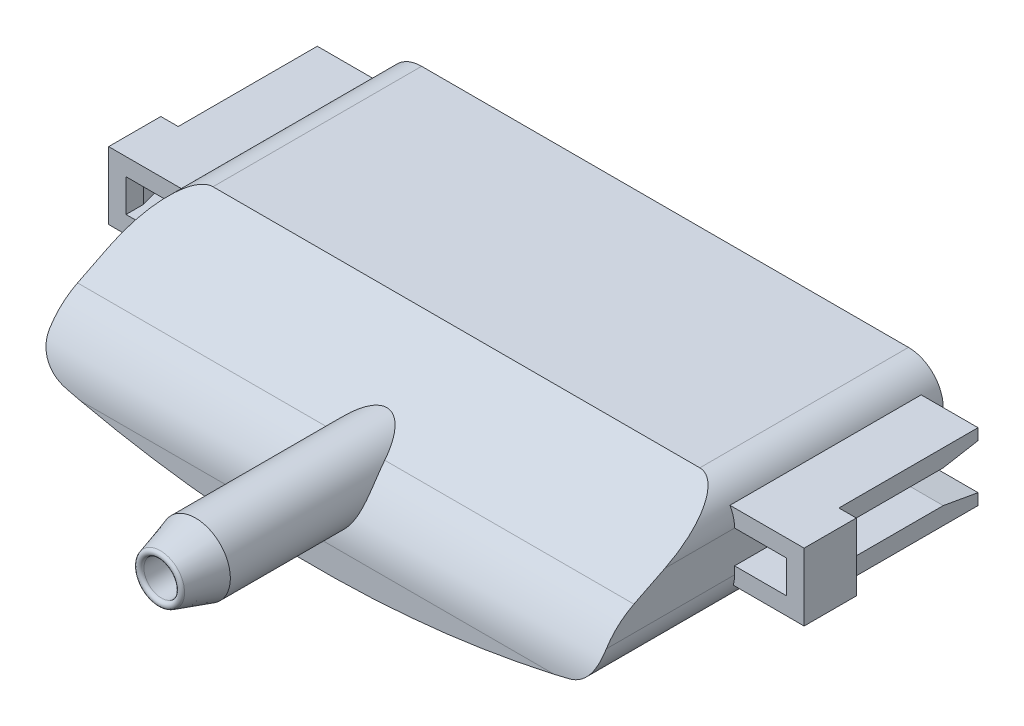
ISO-10303-21;
HEADER;
FILE_DESCRIPTION(('STEP AP214'),'2;1');
FILE_NAME('part.step','',(''),(''),'','','');
FILE_SCHEMA(('AUTOMOTIVE_DESIGN { 1 0 10303 214 1 1 1 1 }'));
ENDSEC;
DATA;
#1=APPLICATION_CONTEXT('core data for automotive mechanical design processes');
#2=APPLICATION_PROTOCOL_DEFINITION('international standard','automotive_design',2000,#1);
#3=PRODUCT_CONTEXT('',#1,'mechanical');
#4=PRODUCT('Part','Part','',(#3));
#5=PRODUCT_RELATED_PRODUCT_CATEGORY('part','',(#4));
#6=PRODUCT_DEFINITION_FORMATION('','',#4);
#7=PRODUCT_DEFINITION_CONTEXT('part definition',#1,'design');
#8=PRODUCT_DEFINITION('design','',#6,#7);
#9=PRODUCT_DEFINITION_SHAPE('','',#8);
#10=(LENGTH_UNIT() NAMED_UNIT(*) SI_UNIT(.MILLI.,.METRE.));
#11=(NAMED_UNIT(*) PLANE_ANGLE_UNIT() SI_UNIT($,.RADIAN.));
#12=(NAMED_UNIT(*) SI_UNIT($,.STERADIAN.) SOLID_ANGLE_UNIT());
#13=UNCERTAINTY_MEASURE_WITH_UNIT(LENGTH_MEASURE(1.E-05),#10,'distance_accuracy_value','');
#14=(GEOMETRIC_REPRESENTATION_CONTEXT(3) GLOBAL_UNCERTAINTY_ASSIGNED_CONTEXT((#13)) GLOBAL_UNIT_ASSIGNED_CONTEXT((#10,
#11,#12)) REPRESENTATION_CONTEXT('',''));
#15=CARTESIAN_POINT('',(0.,0.,0.));
#16=DIRECTION('',(0.,0.,1.));
#17=DIRECTION('',(1.,0.,0.));
#18=AXIS2_PLACEMENT_3D('',#15,#16,#17);
#19=CARTESIAN_POINT('',(16.,-53.5,20.));
#20=DIRECTION('',(-1.,0.,0.));
#21=DIRECTION('',(0.,0.,1.));
#22=AXIS2_PLACEMENT_3D('',#19,#20,#21);
#23=PLANE('',#22);
#24=CARTESIAN_POINT('',(16.,-59.9721359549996,16.));
#25=DIRECTION('',(-1.,0.,0.));
#26=DIRECTION('',(0.,0.,1.));
#27=AXIS2_PLACEMENT_3D('',#24,#25,#26);
#28=CIRCLE('',#27,4.);
#29=CARTESIAN_POINT('',(16.,-56.3944271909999,17.7888543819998));
#30=VERTEX_POINT('',#29);
#31=CARTESIAN_POINT('',(16.,-57.8294907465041,19.3777317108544));
#32=VERTEX_POINT('',#31);
#33=EDGE_CURVE('E649',#30,#32,#28,.F.);
#34=ORIENTED_EDGE('',*,*,#33,.T.);
#35=DIRECTION('',(0.,0.,-1.));
#36=VECTOR('',#35,1.);
#37=CARTESIAN_POINT('',(16.,-57.8294907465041,20.));
#38=LINE('',#37,#36);
#39=CARTESIAN_POINT('',(16.,-57.8294907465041,12.));
#40=VERTEX_POINT('',#39);
#41=EDGE_CURVE('E915',#32,#40,#38,.T.);
#42=ORIENTED_EDGE('',*,*,#41,.T.);
#43=DIRECTION('',(0.,-1.,0.));
#44=VECTOR('',#43,1.);
#45=CARTESIAN_POINT('',(16.,-58.3822364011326,12.));
#46=LINE('',#45,#44);
#47=CARTESIAN_POINT('',(16.,-57.3822364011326,12.));
#48=VERTEX_POINT('',#47);
#49=EDGE_CURVE('E520',#48,#40,#46,.T.);
#50=ORIENTED_EDGE('',*,*,#49,.F.);
#51=DIRECTION('',(0.,0.,1.));
#52=VECTOR('',#51,1.);
#53=CARTESIAN_POINT('',(16.,-57.3822364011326,9.));
#54=LINE('',#53,#52);
#55=CARTESIAN_POINT('',(16.,-57.3822364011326,3.00000000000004));
#56=VERTEX_POINT('',#55);
#57=EDGE_CURVE('E536',#56,#48,#54,.T.);
#58=ORIENTED_EDGE('',*,*,#57,.F.);
#59=DIRECTION('',(0.,0.173648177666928,0.984807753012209));
#60=VECTOR('',#59,1.);
#61=CARTESIAN_POINT('',(16.,-54.3580014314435,20.15128880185));
#62=LINE('',#61,#60);
#63=CARTESIAN_POINT('',(16.,-57.7348903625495,1.));
#64=VERTEX_POINT('',#63);
#65=EDGE_CURVE('E737',#56,#64,#62,.F.);
#66=ORIENTED_EDGE('',*,*,#65,.T.);
#67=DIRECTION('',(0.,1.,0.));
#68=VECTOR('',#67,1.);
#69=CARTESIAN_POINT('',(16.,-58.3822364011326,1.));
#70=LINE('',#69,#68);
#71=CARTESIAN_POINT('',(16.,-57.8294907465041,1.));
#72=VERTEX_POINT('',#71);
#73=EDGE_CURVE('E475',#72,#64,#70,.T.);
#74=ORIENTED_EDGE('',*,*,#73,.F.);
#75=DIRECTION('',(0.,0.,-1.));
#76=VECTOR('',#75,1.);
#77=CARTESIAN_POINT('',(16.,-57.8294907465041,20.));
#78=LINE('',#77,#76);
#79=CARTESIAN_POINT('',(16.,-57.8294907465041,0.));
#80=VERTEX_POINT('',#79);
#81=EDGE_CURVE('E911',#72,#80,#78,.T.);
#82=ORIENTED_EDGE('',*,*,#81,.T.);
#83=DIRECTION('',(0.,1.,0.));
#84=VECTOR('',#83,1.);
#85=CARTESIAN_POINT('',(16.,-53.5,0.));
#86=LINE('',#85,#84);
#87=CARTESIAN_POINT('',(16.,-55.5,0.));
#88=VERTEX_POINT('',#87);
#89=EDGE_CURVE('E641',#80,#88,#86,.T.);
#90=ORIENTED_EDGE('',*,*,#89,.T.);
#91=DIRECTION('',(0.,0.,-1.));
#92=VECTOR('',#91,1.);
#93=CARTESIAN_POINT('',(16.,-55.5,20.));
#94=LINE('',#93,#92);
#95=CARTESIAN_POINT('',(16.,-55.5,3.00000000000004));
#96=VERTEX_POINT('',#95);
#97=EDGE_CURVE('E902',#88,#96,#94,.F.);
#98=ORIENTED_EDGE('',*,*,#97,.T.);
#99=DIRECTION('',(0.,0.,-1.));
#100=VECTOR('',#99,1.);
#101=CARTESIAN_POINT('',(16.,-55.5,7.50000000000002));
#102=LINE('',#101,#100);
#103=CARTESIAN_POINT('',(16.,-55.5,12.));
#104=VERTEX_POINT('',#103);
#105=EDGE_CURVE('E896',#96,#104,#102,.F.);
#106=ORIENTED_EDGE('',*,*,#105,.T.);
#107=DIRECTION('',(0.,0.,-1.));
#108=VECTOR('',#107,1.);
#109=CARTESIAN_POINT('',(16.,-55.5,20.));
#110=LINE('',#109,#108);
#111=CARTESIAN_POINT('',(16.,-55.5,16.));
#112=VERTEX_POINT('',#111);
#113=EDGE_CURVE('E899',#104,#112,#110,.F.);
#114=ORIENTED_EDGE('',*,*,#113,.T.);
#115=DIRECTION('',(0.,-0.447213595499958,0.894427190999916));
#116=VECTOR('',#115,1.);
#117=CARTESIAN_POINT('',(16.,-57.5,20.));
#118=LINE('',#117,#116);
#119=EDGE_CURVE('E622',#112,#30,#118,.T.);
#120=ORIENTED_EDGE('',*,*,#119,.T.);
#121=EDGE_LOOP('',(#34,#42,#50,#58,#66,#74,#82,#90,#98,#106,#114,#120));
#122=FACE_BOUND('',#121,.T.);
#123=ADVANCED_FACE('F42',(#122),#23,.F.);
#124=CARTESIAN_POINT('',(0.,0.,9.));
#125=DIRECTION('',(0.,0.,-1.));
#126=DIRECTION('',(-1.,0.,0.));
#127=AXIS2_PLACEMENT_3D('',#124,#125,#126);
#128=PLANE('',#127);
#129=DIRECTION('',(0.,-1.,0.));
#130=VECTOR('',#129,1.);
#131=CARTESIAN_POINT('',(19.,-57.3822364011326,9.));
#132=LINE('',#131,#130);
#133=CARTESIAN_POINT('',(19.,-57.3822364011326,9.));
#134=VERTEX_POINT('',#133);
#135=CARTESIAN_POINT('',(19.,-58.3822364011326,9.));
#136=VERTEX_POINT('',#135);
#137=EDGE_CURVE('E462',#134,#136,#132,.T.);
#138=ORIENTED_EDGE('',*,*,#137,.F.);
#139=DIRECTION('',(1.,0.,0.));
#140=VECTOR('',#139,1.);
#141=CARTESIAN_POINT('',(0.,-57.3822364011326,9.));
#142=LINE('',#141,#140);
#143=CARTESIAN_POINT('',(19.5358983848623,-57.3822364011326,9.));
#144=VERTEX_POINT('',#143);
#145=EDGE_CURVE('E58',#134,#144,#142,.T.);
#146=ORIENTED_EDGE('',*,*,#145,.T.);
#147=DIRECTION('',(0.,1.,0.));
#148=VECTOR('',#147,1.);
#149=CARTESIAN_POINT('',(19.5358983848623,0.,9.));
#150=LINE('',#149,#148);
#151=CARTESIAN_POINT('',(19.5358983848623,-55.5,9.));
#152=VERTEX_POINT('',#151);
#153=EDGE_CURVE('E869',#144,#152,#150,.T.);
#154=ORIENTED_EDGE('',*,*,#153,.T.);
#155=DIRECTION('',(-1.,0.,0.));
#156=VECTOR('',#155,1.);
#157=CARTESIAN_POINT('',(0.,-55.5,9.));
#158=LINE('',#157,#156);
#159=CARTESIAN_POINT('',(19.,-55.5,9.));
#160=VERTEX_POINT('',#159);
#161=EDGE_CURVE('E867',#152,#160,#158,.T.);
#162=ORIENTED_EDGE('',*,*,#161,.T.);
#163=DIRECTION('',(0.,-1.,0.));
#164=VECTOR('',#163,1.);
#165=CARTESIAN_POINT('',(19.,-54.5,9.));
#166=LINE('',#165,#164);
#167=CARTESIAN_POINT('',(19.,-54.5,9.));
#168=VERTEX_POINT('',#167);
#169=EDGE_CURVE('E486',#168,#160,#166,.T.);
#170=ORIENTED_EDGE('',*,*,#169,.F.);
#171=DIRECTION('',(-1.,0.,0.));
#172=VECTOR('',#171,1.);
#173=CARTESIAN_POINT('',(16.,-54.5,9.));
#174=LINE('',#173,#172);
#175=CARTESIAN_POINT('',(20.,-54.5,9.));
#176=VERTEX_POINT('',#175);
#177=EDGE_CURVE('E507',#176,#168,#174,.T.);
#178=ORIENTED_EDGE('',*,*,#177,.F.);
#179=DIRECTION('',(0.,1.,0.));
#180=VECTOR('',#179,1.);
#181=CARTESIAN_POINT('',(20.,-54.5,9.));
#182=LINE('',#181,#180);
#183=CARTESIAN_POINT('',(20.,-58.3822364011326,9.));
#184=VERTEX_POINT('',#183);
#185=EDGE_CURVE('E503',#184,#176,#182,.T.);
#186=ORIENTED_EDGE('',*,*,#185,.F.);
#187=DIRECTION('',(1.,0.,0.));
#188=VECTOR('',#187,1.);
#189=CARTESIAN_POINT('',(20.,-58.3822364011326,9.));
#190=LINE('',#189,#188);
#191=EDGE_CURVE('E501',#136,#184,#190,.T.);
#192=ORIENTED_EDGE('',*,*,#191,.F.);
#193=EDGE_LOOP('',(#138,#146,#154,#162,#170,#178,#186,#192));
#194=FACE_BOUND('',#193,.T.);
#195=ADVANCED_FACE('F679',(#194),#128,.T.);
#196=CARTESIAN_POINT('',(-24.9442719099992,-59.9721359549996,16.));
#197=DIRECTION('',(-1.,0.,0.));
#198=DIRECTION('',(0.,0.,1.));
#199=AXIS2_PLACEMENT_3D('',#196,#197,#198);
#200=CYLINDRICAL_SURFACE('',#199,4.);
#201=CARTESIAN_POINT('',(-16.,-59.9721359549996,16.));
#202=DIRECTION('',(-1.,0.,0.));
#203=DIRECTION('',(0.,0.,1.));
#204=AXIS2_PLACEMENT_3D('',#201,#202,#203);
#205=CIRCLE('',#204,4.);
#206=CARTESIAN_POINT('',(-16.,-57.8294907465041,19.3777317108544));
#207=VERTEX_POINT('',#206);
#208=CARTESIAN_POINT('',(-16.,-56.3944271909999,17.7888543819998));
#209=VERTEX_POINT('',#208);
#210=EDGE_CURVE('E717',#207,#209,#205,.T.);
#211=ORIENTED_EDGE('',*,*,#210,.F.);
#212=CARTESIAN_POINT('',(-16.,-57.8294907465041,19.3777317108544));
#213=CARTESIAN_POINT('',(-16.0000044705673,-57.8774483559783,19.4081634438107));
#214=CARTESIAN_POINT('',(-15.9982745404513,-57.9260762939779,19.4375676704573));
#215=CARTESIAN_POINT('',(-15.9910929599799,-58.0243617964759,19.4941919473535));
#216=CARTESIAN_POINT('',(-15.9856386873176,-58.0740200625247,19.5214104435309));
#217=CARTESIAN_POINT('',(-15.9707384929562,-58.1740960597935,19.5735477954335));
#218=CARTESIAN_POINT('',(-15.9612838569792,-58.2245152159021,19.5984614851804));
#219=CARTESIAN_POINT('',(-15.9382024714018,-58.3255366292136,19.6457962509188));
#220=CARTESIAN_POINT('',(-15.9245767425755,-58.3761388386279,19.6682179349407));
#221=CARTESIAN_POINT('',(-15.8770513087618,-58.528003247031,19.7318217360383));
#222=CARTESIAN_POINT('',(-15.8365560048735,-58.6289445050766,19.7691473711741));
#223=CARTESIAN_POINT('',(-15.7380312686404,-58.8251207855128,19.8334094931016));
#224=CARTESIAN_POINT('',(-15.6800373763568,-58.9203669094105,19.8603667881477));
#225=CARTESIAN_POINT('',(-15.552537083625,-59.0945702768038,19.9035053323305));
#226=CARTESIAN_POINT('',(-15.4841727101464,-59.1742081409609,19.9203270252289));
#227=CARTESIAN_POINT('',(-15.3350652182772,-59.3223599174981,19.9475922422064));
#228=CARTESIAN_POINT('',(-15.2543077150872,-59.3908607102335,19.9580282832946));
#229=CARTESIAN_POINT('',(-15.0821050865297,-59.514838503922,19.9742706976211));
#230=CARTESIAN_POINT('',(-14.9905886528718,-59.5702203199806,19.9800439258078));
#231=CARTESIAN_POINT('',(-14.7998993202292,-59.6656526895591,19.9885300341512));
#232=CARTESIAN_POINT('',(-14.7007412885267,-59.7057321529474,19.991248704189));
#233=CARTESIAN_POINT('',(-14.5779233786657,-59.7443023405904,19.9935113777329));
#234=CARTESIAN_POINT('',(-14.5565793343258,-59.7506145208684,19.9938656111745));
#235=CARTESIAN_POINT('',(-14.5137173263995,-59.7625160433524,19.9945082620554));
#236=CARTESIAN_POINT('',(-14.4921996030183,-59.7681062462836,19.9947967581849));
#237=CARTESIAN_POINT('',(-14.4705882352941,-59.773339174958,19.9950569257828));
#238=B_SPLINE_CURVE_WITH_KNOTS('',3,(#212,#213,#214,#215,#216,#217,#218,#219,#220,#221,#222,
#223,#224,#225,#226,#227,#228,#229,#230,#231,#232,#233,#234,#235,#236,#237),.UNSPECIFIED.,.F.,
.F.,(4,2,2,2,2,2,2,2,2,2,2,2,4),(0.,0.170376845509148,0.34087377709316,0.511744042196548,
0.682572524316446,1.02550001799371,1.36773565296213,1.68511559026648,2.00286673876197,
2.32285718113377,2.64224005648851,2.70901629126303,2.77571216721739),.UNSPECIFIED.);
#239=CARTESIAN_POINT('',(-14.4705882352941,-59.773339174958,19.9950569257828));
#240=VERTEX_POINT('',#239);
#241=EDGE_CURVE('E793',#207,#240,#238,.T.);
#242=ORIENTED_EDGE('',*,*,#241,.T.);
#243=CARTESIAN_POINT('',(-13.6232488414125,-59.9721359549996,20.));
#244=CARTESIAN_POINT('',(-13.8223256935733,-59.9269138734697,19.9999975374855));
#245=CARTESIAN_POINT('',(-14.0211790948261,-59.8806998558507,19.9992330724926));
#246=CARTESIAN_POINT('',(-14.4183637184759,-59.7863064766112,19.9959607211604));
#247=CARTESIAN_POINT('',(-14.6166950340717,-59.7381274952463,19.9934531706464));
#248=CARTESIAN_POINT('',(-15.0128380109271,-59.6398050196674,19.9864753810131));
#249=CARTESIAN_POINT('',(-15.210649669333,-59.5896615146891,19.9820051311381));
#250=CARTESIAN_POINT('',(-15.6057434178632,-59.4874140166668,19.9708541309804));
#251=CARTESIAN_POINT('',(-15.8030253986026,-59.4353096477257,19.9641729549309));
#252=CARTESIAN_POINT('',(-16.,-59.3822364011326,19.9562632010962));
#253=B_SPLINE_CURVE_WITH_KNOTS('',3,(#243,#244,#245,#246,#247,#248,#249,#250,#251,#252),
.UNSPECIFIED.,.F.,.F.,(4,2,2,2,4),(0.,0.612444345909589,1.22477073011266,1.83710046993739,
2.44954819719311),.UNSPECIFIED.);
#254=CARTESIAN_POINT('',(-13.6232488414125,-59.9721359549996,20.));
#255=VERTEX_POINT('',#254);
#256=EDGE_CURVE('E652',#255,#240,#253,.T.);
#257=ORIENTED_EDGE('',*,*,#256,.F.);
#258=DIRECTION('',(1.,0.,0.));
#259=VECTOR('',#258,1.);
#260=CARTESIAN_POINT('',(-16.,-59.9721359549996,20.));
#261=LINE('',#260,#259);
#262=CARTESIAN_POINT('',(13.6232488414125,-59.9721359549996,20.));
#263=VERTEX_POINT('',#262);
#264=EDGE_CURVE('E1565',#263,#255,#261,.F.);
#265=ORIENTED_EDGE('',*,*,#264,.F.);
#266=CARTESIAN_POINT('',(16.,-59.3822364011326,19.9562632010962));
#267=CARTESIAN_POINT('',(15.8030253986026,-59.4353096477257,19.9641729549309));
#268=CARTESIAN_POINT('',(15.6057434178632,-59.4874140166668,19.9708541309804));
#269=CARTESIAN_POINT('',(15.210649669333,-59.5896615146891,19.9820051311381));
#270=CARTESIAN_POINT('',(15.0128380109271,-59.6398050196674,19.9864753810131));
#271=CARTESIAN_POINT('',(14.6166950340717,-59.7381274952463,19.9934531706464));
#272=CARTESIAN_POINT('',(14.4183637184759,-59.7863064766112,19.9959607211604));
#273=CARTESIAN_POINT('',(14.0211790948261,-59.8806998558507,19.9992330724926));
#274=CARTESIAN_POINT('',(13.8223256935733,-59.9269138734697,19.9999975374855));
#275=CARTESIAN_POINT('',(13.6232488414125,-59.9721359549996,20.));
#276=B_SPLINE_CURVE_WITH_KNOTS('',3,(#266,#267,#268,#269,#270,#271,#272,#273,#274,#275),
.UNSPECIFIED.,.F.,.F.,(4,2,2,2,4),(0.,0.612447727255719,1.22477746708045,1.83710385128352,
2.44954819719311),.UNSPECIFIED.);
#277=CARTESIAN_POINT('',(14.4705882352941,-59.773339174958,19.9950569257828));
#278=VERTEX_POINT('',#277);
#279=EDGE_CURVE('E661',#278,#263,#276,.T.);
#280=ORIENTED_EDGE('',*,*,#279,.F.);
#281=CARTESIAN_POINT('',(14.4705882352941,-59.773339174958,19.9950569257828));
#282=CARTESIAN_POINT('',(14.5242488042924,-59.7603480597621,19.9944047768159));
#283=CARTESIAN_POINT('',(14.577344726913,-59.7451405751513,19.993590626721));
#284=CARTESIAN_POINT('',(14.6820930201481,-59.7103941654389,19.9914664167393));
#285=CARTESIAN_POINT('',(14.7337453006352,-59.6908549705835,19.9901563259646));
#286=CARTESIAN_POINT('',(14.8860473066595,-59.6258980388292,19.9852246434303));
#287=CARTESIAN_POINT('',(14.9840507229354,-59.5741388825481,19.9806015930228));
#288=CARTESIAN_POINT('',(15.1700588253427,-59.4552746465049,19.9669158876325));
#289=CARTESIAN_POINT('',(15.2580500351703,-59.3881492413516,19.9578473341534));
#290=CARTESIAN_POINT('',(15.4212504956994,-59.2409077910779,19.9333002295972));
#291=CARTESIAN_POINT('',(15.4964730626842,-59.1608054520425,19.9178284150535));
#292=CARTESIAN_POINT('',(15.6302463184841,-58.9928972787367,19.8792138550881));
#293=CARTESIAN_POINT('',(15.6891867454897,-58.9053525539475,19.856285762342));
#294=CARTESIAN_POINT('',(15.7917215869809,-58.724232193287,19.8015352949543));
#295=CARTESIAN_POINT('',(15.8353123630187,-58.6306551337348,19.7697108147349));
#296=CARTESIAN_POINT('',(15.9060591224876,-58.443297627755,19.6976362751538));
#297=CARTESIAN_POINT('',(15.9335554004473,-58.3495668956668,19.6575868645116));
#298=CARTESIAN_POINT('',(15.9742884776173,-58.1630868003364,19.569030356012));
#299=CARTESIAN_POINT('',(15.9875345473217,-58.0703368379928,19.5205287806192));
#300=CARTESIAN_POINT('',(15.9962765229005,-57.9541023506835,19.4537518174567));
#301=CARTESIAN_POINT('',(15.997683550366,-57.9289352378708,19.4389226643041));
#302=CARTESIAN_POINT('',(15.9995437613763,-57.8789550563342,19.408730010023));
#303=CARTESIAN_POINT('',(15.99999881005,-57.8541413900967,19.3933676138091));
#304=CARTESIAN_POINT('',(16.,-57.8294907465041,19.3777317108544));
#305=B_SPLINE_CURVE_WITH_KNOTS('',3,(#281,#282,#283,#284,#285,#286,#287,#288,#289,#290,#291,
#292,#293,#294,#295,#296,#297,#298,#299,#300,#301,#302,#303,#304),.UNSPECIFIED.,.F.,.F.,(4,2,2,
2,2,2,2,2,2,2,2,4),(0.,0.165545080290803,0.331100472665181,0.662185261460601,0.993710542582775,
1.32488792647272,1.64726930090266,1.96972704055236,2.28509455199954,2.60025677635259,
2.68797921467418,2.77552962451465),.UNSPECIFIED.);
#306=EDGE_CURVE('E786',#278,#32,#305,.T.);
#307=ORIENTED_EDGE('',*,*,#306,.T.);
#308=ORIENTED_EDGE('',*,*,#33,.F.);
#309=DIRECTION('',(1.,0.,0.));
#310=VECTOR('',#309,1.);
#311=CARTESIAN_POINT('',(16.,-56.3944271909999,17.7888543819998));
#312=LINE('',#311,#310);
#313=CARTESIAN_POINT('',(1.66664596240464,-56.3944271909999,17.7888543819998));
#314=VERTEX_POINT('',#313);
#315=EDGE_CURVE('E637',#314,#30,#312,.T.);
#316=ORIENTED_EDGE('',*,*,#315,.F.);
#317=CARTESIAN_POINT('',(1.66664596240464,-56.3944271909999,17.7888543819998));
#318=CARTESIAN_POINT('',(1.69774652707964,-56.4413054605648,17.8825821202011));
#319=CARTESIAN_POINT('',(1.72846662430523,-56.4919185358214,17.9746251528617));
#320=CARTESIAN_POINT('',(1.78752727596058,-56.6007831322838,18.1552641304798));
#321=CARTESIAN_POINT('',(1.81586059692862,-56.6590565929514,18.2438491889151));
#322=CARTESIAN_POINT('',(1.8686350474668,-56.7838652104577,18.4179581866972));
#323=CARTESIAN_POINT('',(1.89302654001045,-56.8504893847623,18.5034339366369));
#324=CARTESIAN_POINT('',(1.93560037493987,-56.9912291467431,18.6694610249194));
#325=CARTESIAN_POINT('',(1.9537912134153,-57.0653343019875,18.7500189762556));
#326=CARTESIAN_POINT('',(1.98502135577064,-57.2374954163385,18.9222542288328));
#327=CARTESIAN_POINT('',(1.99611099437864,-57.3372745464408,19.0125961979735));
#328=CARTESIAN_POINT('',(2.00217300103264,-57.5455692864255,19.1827203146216));
#329=CARTESIAN_POINT('',(1.99720706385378,-57.6540498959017,19.2625416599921));
#330=CARTESIAN_POINT('',(1.97479525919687,-57.8215981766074,19.3733946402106));
#331=CARTESIAN_POINT('',(1.96471236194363,-57.8786490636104,19.4090732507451));
#332=CARTESIAN_POINT('',(1.93904255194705,-57.9935307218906,19.4770044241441));
#333=CARTESIAN_POINT('',(1.92345869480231,-58.0513610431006,19.5092588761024));
#334=CARTESIAN_POINT('',(1.8864516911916,-58.1670735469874,19.5701575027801));
#335=CARTESIAN_POINT('',(1.86502814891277,-58.2249557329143,19.5988014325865));
#336=CARTESIAN_POINT('',(1.8161811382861,-58.3398759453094,19.6523628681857));
#337=CARTESIAN_POINT('',(1.7887588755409,-58.3969141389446,19.6772811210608));
#338=CARTESIAN_POINT('',(1.70665493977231,-58.5483407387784,19.7394321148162));
#339=CARTESIAN_POINT('',(1.64626851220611,-58.641156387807,19.7731977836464));
#340=CARTESIAN_POINT('',(1.50912544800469,-58.8171944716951,19.830761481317));
#341=CARTESIAN_POINT('',(1.43237342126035,-58.9004195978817,19.8545623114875));
#342=CARTESIAN_POINT('',(1.27155269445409,-59.0472687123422,19.8922881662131));
#343=CARTESIAN_POINT('',(1.1885808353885,-59.1119345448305,19.9068571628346));
#344=CARTESIAN_POINT('',(1.01297654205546,-59.227697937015,19.9305615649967));
#345=CARTESIAN_POINT('',(0.920344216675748,-59.278795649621,19.9396970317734));
#346=CARTESIAN_POINT('',(0.725839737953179,-59.3667610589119,19.954182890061));
#347=CARTESIAN_POINT('',(0.623810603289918,-59.4032955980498,19.9594467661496));
#348=CARTESIAN_POINT('',(0.415089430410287,-59.4594348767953,19.9671078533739));
#349=CARTESIAN_POINT('',(0.308396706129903,-59.4790371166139,19.9695046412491));
#350=CARTESIAN_POINT('',(0.0904044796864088,-59.5010339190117,19.9721776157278));
#351=CARTESIAN_POINT('',(-0.0209425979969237,-59.5029663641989,19.9723968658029));
#352=CARTESIAN_POINT('',(-0.242408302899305,-59.4883550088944,19.9706431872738));
#353=CARTESIAN_POINT('',(-0.352526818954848,-59.471809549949,19.9686700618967));
#354=CARTESIAN_POINT('',(-0.569039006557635,-59.4205826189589,19.9618752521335));
#355=CARTESIAN_POINT('',(-0.675408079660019,-59.3857990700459,19.9570375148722));
#356=CARTESIAN_POINT('',(-0.880653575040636,-59.2991259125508,19.9432185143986));
#357=CARTESIAN_POINT('',(-0.979530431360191,-59.2472372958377,19.9342374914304));
#358=CARTESIAN_POINT('',(-1.16568938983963,-59.1288601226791,19.9105588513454));
#359=CARTESIAN_POINT('',(-1.25309677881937,-59.0625549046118,19.8959313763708));
#360=CARTESIAN_POINT('',(-1.41506882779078,-58.9175276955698,19.8591934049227));
#361=CARTESIAN_POINT('',(-1.48963875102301,-58.8388108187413,19.8370859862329));
#362=CARTESIAN_POINT('',(-1.62180976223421,-58.6749313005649,19.7847598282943));
#363=CARTESIAN_POINT('',(-1.67987449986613,-58.5900527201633,19.7548209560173));
#364=CARTESIAN_POINT('',(-1.78112679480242,-58.4153076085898,19.6857972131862));
#365=CARTESIAN_POINT('',(-1.82431360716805,-58.32544082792,19.6467118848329));
#366=CARTESIAN_POINT('',(-1.89586448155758,-58.1443465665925,19.5593936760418));
#367=CARTESIAN_POINT('',(-1.92423181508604,-58.0531193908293,19.5111628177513));
#368=CARTESIAN_POINT('',(-1.96720867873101,-57.8724565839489,19.4062126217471));
#369=CARTESIAN_POINT('',(-1.98182138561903,-57.7830205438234,19.3494952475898));
#370=CARTESIAN_POINT('',(-2.00222834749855,-57.5753577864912,19.2057426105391));
#371=CARTESIAN_POINT('',(-2.00264413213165,-57.4589437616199,19.1153243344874));
#372=CARTESIAN_POINT('',(-1.98579274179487,-57.2371285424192,18.9225894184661));
#373=CARTESIAN_POINT('',(-1.96843104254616,-57.1317895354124,18.8202117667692));
#374=CARTESIAN_POINT('',(-1.91340500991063,-56.9025912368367,18.571948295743));
#375=CARTESIAN_POINT('',(-1.87101175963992,-56.7836451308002,18.4226472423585));
#376=CARTESIAN_POINT('',(-1.77484643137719,-56.5708393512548,18.1132878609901));
#377=CARTESIAN_POINT('',(-1.72122583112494,-56.4766800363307,17.9533903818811));
#378=CARTESIAN_POINT('',(-1.66664596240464,-56.3944271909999,17.7888543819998));
#379=B_SPLINE_CURVE_WITH_KNOTS('',3,(#317,#318,#319,#320,#321,#322,#323,#324,#325,#326,#327,
#328,#329,#330,#331,#332,#333,#334,#335,#336,#337,#338,#339,#340,#341,#342,#343,#344,#345,#346,
#347,#348,#349,#350,#351,#352,#353,#354,#355,#356,#357,#358,#359,#360,#361,#362,#363,#364,#365,
#366,#367,#368,#369,#370,#371,#372,#373,#374,#375,#376,#377,#378),.UNSPECIFIED.,.F.,.F.,(4,2,2,
2,2,2,2,2,2,2,2,2,2,2,2,2,2,2,2,2,2,2,2,2,2,2,2,2,2,2,4),(0.,0.327943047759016,
0.656846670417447,0.989614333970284,1.32192419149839,1.72571175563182,2.12794958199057,
2.33180549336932,2.53554834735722,2.73930501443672,2.94302076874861,3.28822311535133,
3.63332835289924,3.95046922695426,4.2676065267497,4.59163158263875,4.91570446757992,
5.24822932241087,5.58078402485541,5.91522019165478,6.24963696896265,6.58002666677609,
6.91028058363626,7.23004731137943,7.54983004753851,7.86954215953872,8.18918041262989,
8.62895175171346,9.07107359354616,9.65515219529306,10.2318069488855),.UNSPECIFIED.);
#380=CARTESIAN_POINT('',(-1.66664596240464,-56.3944271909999,17.7888543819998));
#381=VERTEX_POINT('',#380);
#382=EDGE_CURVE('E708',#314,#381,#379,.T.);
#383=ORIENTED_EDGE('',*,*,#382,.T.);
#384=EDGE_CURVE('E646',#209,#381,#312,.T.);
#385=ORIENTED_EDGE('',*,*,#384,.F.);
#386=EDGE_LOOP('',(#211,#242,#257,#265,#280,#307,#308,#316,#383,#385));
#387=FACE_BOUND('',#386,.T.);
#388=ADVANCED_FACE('F667',(#387),#200,.T.);
#389=CARTESIAN_POINT('',(0.,0.,20.));
#390=DIRECTION('',(0.,0.,-1.));
#391=DIRECTION('',(-1.,0.,0.));
#392=AXIS2_PLACEMENT_3D('',#389,#390,#391);
#393=CYLINDRICAL_SURFACE('',#392,61.5);
#394=ORIENTED_EDGE('',*,*,#256,.T.);
#395=DIRECTION('',(0.,0.,-1.));
#396=VECTOR('',#395,1.);
#397=CARTESIAN_POINT('',(-14.4705882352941,-59.773339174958,20.));
#398=LINE('',#397,#396);
#399=CARTESIAN_POINT('',(-14.4705882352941,-59.773339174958,0.));
#400=VERTEX_POINT('',#399);
#401=EDGE_CURVE('E783',#240,#400,#398,.T.);
#402=ORIENTED_EDGE('',*,*,#401,.T.);
#403=CARTESIAN_POINT('',(0.,0.,0.));
#404=DIRECTION('',(0.,0.,1.));
#405=DIRECTION('',(1.,0.,0.));
#406=AXIS2_PLACEMENT_3D('',#403,#404,#405);
#407=CIRCLE('',#406,61.5);
#408=CARTESIAN_POINT('',(14.4705882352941,-59.773339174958,0.));
#409=VERTEX_POINT('',#408);
#410=EDGE_CURVE('E633',#400,#409,#407,.T.);
#411=ORIENTED_EDGE('',*,*,#410,.T.);
#412=DIRECTION('',(0.,0.,-1.));
#413=VECTOR('',#412,1.);
#414=CARTESIAN_POINT('',(14.4705882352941,-59.773339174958,20.));
#415=LINE('',#414,#413);
#416=EDGE_CURVE('E781',#409,#278,#415,.F.);
#417=ORIENTED_EDGE('',*,*,#416,.T.);
#418=ORIENTED_EDGE('',*,*,#279,.T.);
#419=CARTESIAN_POINT('',(0.,0.,20.));
#420=DIRECTION('',(0.,0.,1.));
#421=DIRECTION('',(1.,0.,0.));
#422=AXIS2_PLACEMENT_3D('',#419,#420,#421);
#423=CIRCLE('',#422,61.5);
#424=EDGE_CURVE('E634',#255,#263,#423,.T.);
#425=ORIENTED_EDGE('',*,*,#424,.F.);
#426=EDGE_LOOP('',(#394,#402,#411,#417,#418,#425));
#427=FACE_BOUND('',#426,.T.);
#428=ADVANCED_FACE('F670',(#427),#393,.T.);
#429=CARTESIAN_POINT('',(0.,-53.5,20.));
#430=DIRECTION('',(0.,-1.,0.));
#431=DIRECTION('',(0.,0.,-1.));
#432=AXIS2_PLACEMENT_3D('',#429,#430,#431);
#433=PLANE('',#432);
#434=DIRECTION('',(-1.,0.,0.));
#435=VECTOR('',#434,1.);
#436=CARTESIAN_POINT('',(0.,-53.5,0.));
#437=LINE('',#436,#435);
#438=CARTESIAN_POINT('',(14.,-53.5,0.));
#439=VERTEX_POINT('',#438);
#440=CARTESIAN_POINT('',(-14.,-53.5,0.));
#441=VERTEX_POINT('',#440);
#442=EDGE_CURVE('E638',#439,#441,#437,.T.);
#443=ORIENTED_EDGE('',*,*,#442,.T.);
#444=DIRECTION('',(0.,0.,-1.));
#445=VECTOR('',#444,1.);
#446=CARTESIAN_POINT('',(-14.,-53.5,12.));
#447=LINE('',#446,#445);
#448=CARTESIAN_POINT('',(-14.,-53.5,12.));
#449=VERTEX_POINT('',#448);
#450=EDGE_CURVE('E775',#441,#449,#447,.F.);
#451=ORIENTED_EDGE('',*,*,#450,.T.);
#452=DIRECTION('',(1.,0.,0.));
#453=VECTOR('',#452,1.);
#454=CARTESIAN_POINT('',(-24.9442719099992,-53.5,12.));
#455=LINE('',#454,#453);
#456=CARTESIAN_POINT('',(14.,-53.5,12.));
#457=VERTEX_POINT('',#456);
#458=EDGE_CURVE('E627',#449,#457,#455,.T.);
#459=ORIENTED_EDGE('',*,*,#458,.T.);
#460=DIRECTION('',(0.,0.,-1.));
#461=VECTOR('',#460,1.);
#462=CARTESIAN_POINT('',(14.,-53.5,20.));
#463=LINE('',#462,#461);
#464=EDGE_CURVE('E772',#457,#439,#463,.T.);
#465=ORIENTED_EDGE('',*,*,#464,.T.);
#466=EDGE_LOOP('',(#443,#451,#459,#465));
#467=FACE_BOUND('',#466,.T.);
#468=ADVANCED_FACE('F674',(#467),#433,.F.);
#469=CARTESIAN_POINT('',(0.,0.,20.));
#470=DIRECTION('',(0.,0.,1.));
#471=DIRECTION('',(1.,0.,0.));
#472=AXIS2_PLACEMENT_3D('',#469,#470,#471);
#473=PLANE('',#472);
#474=ORIENTED_EDGE('',*,*,#424,.T.);
#475=ORIENTED_EDGE('',*,*,#264,.T.);
#476=EDGE_LOOP('',(#474,#475));
#477=FACE_BOUND('',#476,.T.);
#478=ADVANCED_FACE('F683',(#477),#473,.T.);
#479=CARTESIAN_POINT('',(0.,0.,0.));
#480=DIRECTION('',(0.,0.,1.));
#481=DIRECTION('',(1.,0.,0.));
#482=AXIS2_PLACEMENT_3D('',#479,#480,#481);
#483=PLANE('',#482);
#484=DIRECTION('',(0.,1.,0.));
#485=VECTOR('',#484,1.);
#486=CARTESIAN_POINT('',(-15.,-53.5,0.));
#487=LINE('',#486,#485);
#488=CARTESIAN_POINT('',(-15.,-57.8294907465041,0.));
#489=VERTEX_POINT('',#488);
#490=CARTESIAN_POINT('',(-15.,-55.5,0.));
#491=VERTEX_POINT('',#490);
#492=EDGE_CURVE('E604',#489,#491,#487,.T.);
#493=ORIENTED_EDGE('',*,*,#492,.F.);
#494=CARTESIAN_POINT('',(-14.,-57.8294907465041,0.));
#495=DIRECTION('',(0.,0.,1.));
#496=DIRECTION('',(1.,0.,0.));
#497=AXIS2_PLACEMENT_3D('',#494,#495,#496);
#498=CIRCLE('',#497,1.);
#499=CARTESIAN_POINT('',(-14.2352941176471,-58.801414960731,0.));
#500=VERTEX_POINT('',#499);
#501=EDGE_CURVE('E848',#489,#500,#498,.T.);
#502=ORIENTED_EDGE('',*,*,#501,.T.);
#503=CARTESIAN_POINT('',(0.,0.,0.));
#504=DIRECTION('',(0.,0.,1.));
#505=DIRECTION('',(1.,0.,0.));
#506=AXIS2_PLACEMENT_3D('',#503,#504,#505);
#507=CIRCLE('',#506,60.5);
#508=CARTESIAN_POINT('',(14.2352941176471,-58.801414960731,0.));
#509=VERTEX_POINT('',#508);
#510=EDGE_CURVE('E608',#500,#509,#507,.T.);
#511=ORIENTED_EDGE('',*,*,#510,.T.);
#512=CARTESIAN_POINT('',(14.,-57.8294907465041,0.));
#513=DIRECTION('',(0.,0.,1.));
#514=DIRECTION('',(1.,0.,0.));
#515=AXIS2_PLACEMENT_3D('',#512,#513,#514);
#516=CIRCLE('',#515,1.);
#517=CARTESIAN_POINT('',(15.,-57.8294907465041,0.));
#518=VERTEX_POINT('',#517);
#519=EDGE_CURVE('E854',#509,#518,#516,.T.);
#520=ORIENTED_EDGE('',*,*,#519,.T.);
#521=DIRECTION('',(0.,1.,0.));
#522=VECTOR('',#521,1.);
#523=CARTESIAN_POINT('',(15.,-53.5,0.));
#524=LINE('',#523,#522);
#525=CARTESIAN_POINT('',(15.,-55.5,0.));
#526=VERTEX_POINT('',#525);
#527=EDGE_CURVE('E611',#518,#526,#524,.T.);
#528=ORIENTED_EDGE('',*,*,#527,.T.);
#529=CARTESIAN_POINT('',(14.,-55.5,0.));
#530=DIRECTION('',(0.,0.,1.));
#531=DIRECTION('',(1.,0.,0.));
#532=AXIS2_PLACEMENT_3D('',#529,#530,#531);
#533=CIRCLE('',#532,1.);
#534=CARTESIAN_POINT('',(14.,-54.5,0.));
#535=VERTEX_POINT('',#534);
#536=EDGE_CURVE('E852',#526,#535,#533,.T.);
#537=ORIENTED_EDGE('',*,*,#536,.T.);
#538=DIRECTION('',(-1.,0.,0.));
#539=VECTOR('',#538,1.);
#540=CARTESIAN_POINT('',(0.,-54.5,0.));
#541=LINE('',#540,#539);
#542=CARTESIAN_POINT('',(-14.,-54.5,0.));
#543=VERTEX_POINT('',#542);
#544=EDGE_CURVE('E596',#535,#543,#541,.T.);
#545=ORIENTED_EDGE('',*,*,#544,.T.);
#546=CARTESIAN_POINT('',(-14.,-55.5,0.));
#547=DIRECTION('',(0.,0.,1.));
#548=DIRECTION('',(1.,0.,0.));
#549=AXIS2_PLACEMENT_3D('',#546,#547,#548);
#550=CIRCLE('',#549,1.);
#551=EDGE_CURVE('E850',#543,#491,#550,.T.);
#552=ORIENTED_EDGE('',*,*,#551,.T.);
#553=EDGE_LOOP('',(#493,#502,#511,#520,#528,#537,#545,#552));
#554=FACE_BOUND('',#553,.T.);
#555=DIRECTION('',(0.,1.,0.));
#556=VECTOR('',#555,1.);
#557=CARTESIAN_POINT('',(-16.,-53.5,0.));
#558=LINE('',#557,#556);
#559=CARTESIAN_POINT('',(-16.,-57.8294907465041,0.));
#560=VERTEX_POINT('',#559);
#561=CARTESIAN_POINT('',(-16.,-55.5,0.));
#562=VERTEX_POINT('',#561);
#563=EDGE_CURVE('E630',#560,#562,#558,.T.);
#564=ORIENTED_EDGE('',*,*,#563,.T.);
#565=CARTESIAN_POINT('',(-14.,-55.5,0.));
#566=DIRECTION('',(0.,0.,1.));
#567=DIRECTION('',(1.,0.,0.));
#568=AXIS2_PLACEMENT_3D('',#565,#566,#567);
#569=CIRCLE('',#568,2.);
#570=EDGE_CURVE('E770',#562,#441,#569,.F.);
#571=ORIENTED_EDGE('',*,*,#570,.T.);
#572=ORIENTED_EDGE('',*,*,#442,.F.);
#573=CARTESIAN_POINT('',(14.,-55.5,0.));
#574=DIRECTION('',(0.,0.,1.));
#575=DIRECTION('',(1.,0.,0.));
#576=AXIS2_PLACEMENT_3D('',#573,#574,#575);
#577=CIRCLE('',#576,2.);
#578=EDGE_CURVE('E764',#439,#88,#577,.F.);
#579=ORIENTED_EDGE('',*,*,#578,.T.);
#580=ORIENTED_EDGE('',*,*,#89,.F.);
#581=CARTESIAN_POINT('',(14.,-57.8294907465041,0.));
#582=DIRECTION('',(0.,0.,1.));
#583=DIRECTION('',(1.,0.,0.));
#584=AXIS2_PLACEMENT_3D('',#581,#582,#583);
#585=CIRCLE('',#584,2.);
#586=EDGE_CURVE('E766',#80,#409,#585,.F.);
#587=ORIENTED_EDGE('',*,*,#586,.T.);
#588=ORIENTED_EDGE('',*,*,#410,.F.);
#589=CARTESIAN_POINT('',(-14.,-57.8294907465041,0.));
#590=DIRECTION('',(0.,0.,1.));
#591=DIRECTION('',(1.,0.,0.));
#592=AXIS2_PLACEMENT_3D('',#589,#590,#591);
#593=CIRCLE('',#592,2.);
#594=EDGE_CURVE('E768',#400,#560,#593,.F.);
#595=ORIENTED_EDGE('',*,*,#594,.T.);
#596=EDGE_LOOP('',(#564,#571,#572,#579,#580,#587,#588,#595));
#597=FACE_BOUND('',#596,.T.);
#598=ADVANCED_FACE('F685',(#554,#597),#483,.F.);
#599=CARTESIAN_POINT('',(-16.,-53.5,20.));
#600=DIRECTION('',(-1.,0.,0.));
#601=DIRECTION('',(0.,0.,1.));
#602=AXIS2_PLACEMENT_3D('',#599,#600,#601);
#603=PLANE('',#602);
#604=DIRECTION('',(0.,0.447213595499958,-0.894427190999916));
#605=VECTOR('',#604,1.);
#606=CARTESIAN_POINT('',(-16.,-57.5,20.));
#607=LINE('',#606,#605);
#608=CARTESIAN_POINT('',(-16.,-55.5,16.));
#609=VERTEX_POINT('',#608);
#610=EDGE_CURVE('E624',#209,#609,#607,.T.);
#611=ORIENTED_EDGE('',*,*,#610,.T.);
#612=DIRECTION('',(0.,0.,-1.));
#613=VECTOR('',#612,1.);
#614=CARTESIAN_POINT('',(-16.,-55.5,0.));
#615=LINE('',#614,#613);
#616=CARTESIAN_POINT('',(-16.,-55.5,12.));
#617=VERTEX_POINT('',#616);
#618=EDGE_CURVE('E762',#609,#617,#615,.T.);
#619=ORIENTED_EDGE('',*,*,#618,.T.);
#620=DIRECTION('',(0.,0.,1.));
#621=VECTOR('',#620,1.);
#622=CARTESIAN_POINT('',(-16.,-55.5,7.50000000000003));
#623=LINE('',#622,#621);
#624=CARTESIAN_POINT('',(-16.,-55.5,3.00000000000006));
#625=VERTEX_POINT('',#624);
#626=EDGE_CURVE('E905',#625,#617,#623,.T.);
#627=ORIENTED_EDGE('',*,*,#626,.F.);
#628=DIRECTION('',(0.,0.,-1.));
#629=VECTOR('',#628,1.);
#630=CARTESIAN_POINT('',(-16.,-55.5,0.));
#631=LINE('',#630,#629);
#632=EDGE_CURVE('E760',#625,#562,#631,.T.);
#633=ORIENTED_EDGE('',*,*,#632,.T.);
#634=ORIENTED_EDGE('',*,*,#563,.F.);
#635=DIRECTION('',(0.,0.,1.));
#636=VECTOR('',#635,1.);
#637=CARTESIAN_POINT('',(-16.,-57.8294907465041,19.9562632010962));
#638=LINE('',#637,#636);
#639=CARTESIAN_POINT('',(-16.,-57.8294907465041,1.));
#640=VERTEX_POINT('',#639);
#641=EDGE_CURVE('E758',#560,#640,#638,.T.);
#642=ORIENTED_EDGE('',*,*,#641,.T.);
#643=DIRECTION('',(0.,1.,0.));
#644=VECTOR('',#643,1.);
#645=CARTESIAN_POINT('',(-16.,-58.3822364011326,1.));
#646=LINE('',#645,#644);
#647=CARTESIAN_POINT('',(-16.,-57.7348903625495,1.));
#648=VERTEX_POINT('',#647);
#649=EDGE_CURVE('E396',#640,#648,#646,.T.);
#650=ORIENTED_EDGE('',*,*,#649,.T.);
#651=DIRECTION('',(0.,0.173648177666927,0.984807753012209));
#652=VECTOR('',#651,1.);
#653=CARTESIAN_POINT('',(-16.,-57.3822364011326,3.00000000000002));
#654=LINE('',#653,#652);
#655=CARTESIAN_POINT('',(-16.,-57.3822364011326,3.00000000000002));
#656=VERTEX_POINT('',#655);
#657=EDGE_CURVE('E753',#648,#656,#654,.T.);
#658=ORIENTED_EDGE('',*,*,#657,.T.);
#659=DIRECTION('',(0.,0.,1.));
#660=VECTOR('',#659,1.);
#661=CARTESIAN_POINT('',(-16.,-57.3822364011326,9.));
#662=LINE('',#661,#660);
#663=CARTESIAN_POINT('',(-16.,-57.3822364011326,12.));
#664=VERTEX_POINT('',#663);
#665=EDGE_CURVE('E465',#656,#664,#662,.T.);
#666=ORIENTED_EDGE('',*,*,#665,.T.);
#667=DIRECTION('',(0.,-1.,0.));
#668=VECTOR('',#667,1.);
#669=CARTESIAN_POINT('',(-16.,-58.3822364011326,12.));
#670=LINE('',#669,#668);
#671=CARTESIAN_POINT('',(-16.,-57.8294907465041,12.));
#672=VERTEX_POINT('',#671);
#673=EDGE_CURVE('E449',#664,#672,#670,.T.);
#674=ORIENTED_EDGE('',*,*,#673,.T.);
#675=DIRECTION('',(0.,0.,1.));
#676=VECTOR('',#675,1.);
#677=CARTESIAN_POINT('',(-16.,-57.8294907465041,19.9562632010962));
#678=LINE('',#677,#676);
#679=EDGE_CURVE('E756',#672,#207,#678,.T.);
#680=ORIENTED_EDGE('',*,*,#679,.T.);
#681=ORIENTED_EDGE('',*,*,#210,.T.);
#682=EDGE_LOOP('',(#611,#619,#627,#633,#634,#642,#650,#658,#666,#674,#680,#681));
#683=FACE_BOUND('',#682,.T.);
#684=ADVANCED_FACE('F688',(#683),#603,.T.);
#685=CARTESIAN_POINT('',(-24.9442719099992,-57.5,20.));
#686=DIRECTION('',(0.,-0.894427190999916,-0.447213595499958));
#687=DIRECTION('',(0.,0.447213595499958,-0.894427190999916));
#688=AXIS2_PLACEMENT_3D('',#685,#686,#687);
#689=PLANE('',#688);
#690=ORIENTED_EDGE('',*,*,#458,.F.);
#691=CARTESIAN_POINT('',(-14.,-55.5,16.));
#692=DIRECTION('',(0.,-0.894427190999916,-0.447213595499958));
#693=DIRECTION('',(0.,-0.447213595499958,0.894427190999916));
#694=AXIS2_PLACEMENT_3D('',#691,#692,#693);
#695=ELLIPSE('',#694,4.47213595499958,2.);
#696=EDGE_CURVE('E779',#449,#609,#695,.F.);
#697=ORIENTED_EDGE('',*,*,#696,.T.);
#698=ORIENTED_EDGE('',*,*,#610,.F.);
#699=ORIENTED_EDGE('',*,*,#384,.T.);
#700=CARTESIAN_POINT('',(0.,-57.5,20.));
#701=DIRECTION('',(0.,-0.894427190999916,-0.447213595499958));
#702=DIRECTION('',(0.,-0.447213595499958,0.894427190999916));
#703=AXIS2_PLACEMENT_3D('',#700,#701,#702);
#704=ELLIPSE('',#703,4.47213595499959,2.);
#705=EDGE_CURVE('E620',#314,#381,#704,.F.);
#706=ORIENTED_EDGE('',*,*,#705,.F.);
#707=ORIENTED_EDGE('',*,*,#315,.T.);
#708=ORIENTED_EDGE('',*,*,#119,.F.);
#709=CARTESIAN_POINT('',(14.,-55.5,16.));
#710=DIRECTION('',(0.,-0.894427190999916,-0.447213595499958));
#711=DIRECTION('',(0.,0.447213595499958,-0.894427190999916));
#712=AXIS2_PLACEMENT_3D('',#709,#710,#711);
#713=ELLIPSE('',#712,4.47213595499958,2.);
#714=EDGE_CURVE('E777',#112,#457,#713,.F.);
#715=ORIENTED_EDGE('',*,*,#714,.T.);
#716=EDGE_LOOP('',(#690,#697,#698,#699,#706,#707,#708,#715));
#717=FACE_BOUND('',#716,.T.);
#718=ADVANCED_FACE('F695',(#717),#689,.F.);
#719=CARTESIAN_POINT('',(0.,-57.5,52.715092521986));
#720=DIRECTION('',(0.,0.,1.));
#721=DIRECTION('',(1.,0.,0.));
#722=AXIS2_PLACEMENT_3D('',#719,#720,#721);
#723=CYLINDRICAL_SURFACE('',#722,2.);
#724=CARTESIAN_POINT('',(0.,-57.5,27.));
#725=DIRECTION('',(0.,0.,1.));
#726=DIRECTION('',(1.,0.,0.));
#727=AXIS2_PLACEMENT_3D('',#724,#725,#726);
#728=CIRCLE('',#727,2.);
#729=CARTESIAN_POINT('',(2.,-57.5,27.));
#730=VERTEX_POINT('',#729);
#731=EDGE_CURVE('E555',#730,#730,#728,.T.);
#732=ORIENTED_EDGE('',*,*,#731,.F.);
#733=EDGE_LOOP('',(#732));
#734=FACE_BOUND('',#733,.T.);
#735=ORIENTED_EDGE('',*,*,#705,.T.);
#736=ORIENTED_EDGE('',*,*,#382,.F.);
#737=EDGE_LOOP('',(#735,#736));
#738=FACE_BOUND('',#737,.T.);
#739=ADVANCED_FACE('F699',(#734,#738),#723,.T.);
#740=CARTESIAN_POINT('',(0.,-57.5,27.));
#741=DIRECTION('',(0.,0.,-1.));
#742=DIRECTION('',(-1.,0.,0.));
#743=AXIS2_PLACEMENT_3D('',#740,#741,#742);
#744=CONICAL_SURFACE('',#743,2.,0.291456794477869);
#745=CARTESIAN_POINT('',(0.,-57.5,29.0281158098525));
#746=DIRECTION('',(0.,0.,-1.));
#747=DIRECTION('',(-1.,0.,0.));
#748=AXIS2_PLACEMENT_3D('',#745,#746,#747);
#749=CIRCLE('',#748,1.39156525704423);
#750=CARTESIAN_POINT('',(-1.39156525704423,-57.5,29.0281158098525));
#751=VERTEX_POINT('',#750);
#752=EDGE_CURVE('E716',#751,#751,#749,.T.);
#753=ORIENTED_EDGE('',*,*,#752,.T.);
#754=EDGE_LOOP('',(#753));
#755=FACE_BOUND('',#754,.T.);
#756=ORIENTED_EDGE('',*,*,#731,.T.);
#757=EDGE_LOOP('',(#756));
#758=FACE_BOUND('',#757,.T.);
#759=ADVANCED_FACE('F704',(#755,#758),#744,.T.);
#760=CARTESIAN_POINT('',(-24.9442719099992,-59.9721359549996,16.));
#761=DIRECTION('',(-1.,0.,0.));
#762=DIRECTION('',(0.,0.,1.));
#763=AXIS2_PLACEMENT_3D('',#760,#761,#762);
#764=CYLINDRICAL_SURFACE('',#763,3.);
#765=CARTESIAN_POINT('',(-7.97451622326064,-59.9721359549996,19.));
#766=CARTESIAN_POINT('',(-8.22331687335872,-59.9390529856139,18.9999939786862));
#767=CARTESIAN_POINT('',(-8.47191299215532,-59.9044212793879,18.9994525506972));
#768=CARTESIAN_POINT('',(-8.96865622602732,-59.8320666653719,18.9969485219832));
#769=CARTESIAN_POINT('',(-9.21680332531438,-59.7943436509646,18.994985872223));
#770=CARTESIAN_POINT('',(-9.71277997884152,-59.7157851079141,18.9892868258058));
#771=CARTESIAN_POINT('',(-9.96060914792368,-59.6749472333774,18.9855490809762));
#772=CARTESIAN_POINT('',(-10.4556915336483,-59.5901971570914,18.9758925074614));
#773=CARTESIAN_POINT('',(-10.7029447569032,-59.5462849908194,18.9699737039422));
#774=CARTESIAN_POINT('',(-11.4418607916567,-59.4103019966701,18.9483547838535));
#775=CARTESIAN_POINT('',(-11.9326047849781,-59.3136796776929,18.9287765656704));
#776=CARTESIAN_POINT('',(-12.6661334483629,-59.1597961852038,18.8884065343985));
#777=CARTESIAN_POINT('',(-12.9101753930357,-59.1070186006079,18.8731191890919));
#778=CARTESIAN_POINT('',(-13.3972877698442,-58.9985163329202,18.8381894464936));
#779=CARTESIAN_POINT('',(-13.6403582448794,-58.9427917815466,18.8185472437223));
#780=CARTESIAN_POINT('',(-14.0697386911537,-58.8415611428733,18.7792153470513));
#781=CARTESIAN_POINT('',(-14.2562824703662,-58.7966421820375,18.7605694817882));
#782=CARTESIAN_POINT('',(-14.628703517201,-58.7050922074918,18.7197599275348));
#783=CARTESIAN_POINT('',(-14.8145802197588,-58.6584600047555,18.6975937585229));
#784=CARTESIAN_POINT('',(-15.,-58.6110057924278,18.6734480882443));
#785=B_SPLINE_CURVE_WITH_KNOTS('',3,(#765,#766,#767,#768,#769,#770,#771,#772,#773,#774,#775,
#776,#777,#778,#779,#780,#781,#782,#783,#784),.UNSPECIFIED.,.F.,.F.,(4,2,2,2,2,2,2,2,2,4),(0.,
0.752967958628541,1.50596189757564,2.25952864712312,3.01308670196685,4.51435840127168,
5.26476930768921,6.01514670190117,6.59344751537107,7.1721575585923),.UNSPECIFIED.);
#786=CARTESIAN_POINT('',(-7.97451622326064,-59.9721359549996,19.));
#787=VERTEX_POINT('',#786);
#788=CARTESIAN_POINT('',(-14.2352941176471,-58.801414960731,18.7621390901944));
#789=VERTEX_POINT('',#788);
#790=EDGE_CURVE('E577',#787,#789,#785,.T.);
#791=ORIENTED_EDGE('',*,*,#790,.T.);
#792=CARTESIAN_POINT('',(-14.2352941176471,-58.801414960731,18.7621390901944));
#793=CARTESIAN_POINT('',(-14.2610315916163,-58.7951852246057,18.7594966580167));
#794=CARTESIAN_POINT('',(-14.2864642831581,-58.7879440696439,18.7564047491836));
#795=CARTESIAN_POINT('',(-14.3365576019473,-58.7715225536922,18.7492926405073));
#796=CARTESIAN_POINT('',(-14.3612183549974,-58.7623425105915,18.7452725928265));
#797=CARTESIAN_POINT('',(-14.4336356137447,-58.7320893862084,18.7318074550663));
#798=CARTESIAN_POINT('',(-14.4800165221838,-58.7082567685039,18.7209385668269));
#799=CARTESIAN_POINT('',(-14.5677196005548,-58.654323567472,18.6952287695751));
#800=CARTESIAN_POINT('',(-14.6090414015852,-58.6242225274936,18.6803875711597));
#801=CARTESIAN_POINT('',(-14.6857097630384,-58.5591012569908,18.6466346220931));
#802=CARTESIAN_POINT('',(-14.7210555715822,-58.5240804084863,18.6277223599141));
#803=CARTESIAN_POINT('',(-14.7860740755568,-58.449648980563,18.5853264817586));
#804=CARTESIAN_POINT('',(-14.815568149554,-58.4101455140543,18.561733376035));
#805=CARTESIAN_POINT('',(-14.8675473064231,-58.329170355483,18.5105695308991));
#806=CARTESIAN_POINT('',(-14.8900296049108,-58.2876978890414,18.4829972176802));
#807=CARTESIAN_POINT('',(-14.9303376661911,-58.1997085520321,18.421094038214));
#808=CARTESIAN_POINT('',(-14.9473967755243,-58.1531312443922,18.3863547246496));
#809=CARTESIAN_POINT('',(-14.9740611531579,-58.0608272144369,18.3130879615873));
#810=CARTESIAN_POINT('',(-14.9836613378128,-58.0151010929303,18.2745579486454));
#811=CARTESIAN_POINT('',(-14.9934650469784,-57.9462087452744,18.2128432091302));
#812=CARTESIAN_POINT('',(-14.9959597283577,-57.9223438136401,18.1907558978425));
#813=CARTESIAN_POINT('',(-14.9992236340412,-57.8753581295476,18.1458277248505));
#814=CARTESIAN_POINT('',(-14.9999983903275,-57.8522352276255,18.1229895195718));
#815=CARTESIAN_POINT('',(-15.,-57.8294907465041,18.0997789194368));
#816=B_SPLINE_CURVE_WITH_KNOTS('',3,(#792,#793,#794,#795,#796,#797,#798,#799,#800,#801,#802,
#803,#804,#805,#806,#807,#808,#809,#810,#811,#812,#813,#814,#815),.UNSPECIFIED.,.F.,.F.,(4,2,2,
2,2,2,2,2,2,2,2,4),(0.,0.0797856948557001,0.159558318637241,0.318523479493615,0.477500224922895,
0.636496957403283,0.799779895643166,0.963127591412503,1.14414282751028,1.32528132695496,
1.42306642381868,1.52053654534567),.UNSPECIFIED.);
#817=CARTESIAN_POINT('',(-15.,-57.8294907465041,18.0997789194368));
#818=VERTEX_POINT('',#817);
#819=EDGE_CURVE('E820',#789,#818,#816,.T.);
#820=ORIENTED_EDGE('',*,*,#819,.T.);
#821=CARTESIAN_POINT('',(-15.,-59.9721359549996,16.));
#822=DIRECTION('',(-1.,0.,0.));
#823=DIRECTION('',(0.,0.,1.));
#824=AXIS2_PLACEMENT_3D('',#821,#822,#823);
#825=CIRCLE('',#824,3.);
#826=CARTESIAN_POINT('',(-15.,-57.2888543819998,17.3416407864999));
#827=VERTEX_POINT('',#826);
#828=EDGE_CURVE('E556',#818,#827,#825,.T.);
#829=ORIENTED_EDGE('',*,*,#828,.T.);
#830=DIRECTION('',(1.,0.,0.));
#831=VECTOR('',#830,1.);
#832=CARTESIAN_POINT('',(-24.9442719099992,-57.2888543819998,17.3416407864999));
#833=LINE('',#832,#831);
#834=CARTESIAN_POINT('',(-0.977454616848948,-57.2888543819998,17.3416407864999));
#835=VERTEX_POINT('',#834);
#836=EDGE_CURVE('E544',#827,#835,#833,.T.);
#837=ORIENTED_EDGE('',*,*,#836,.T.);
#838=CARTESIAN_POINT('',(0.977454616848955,-57.2888543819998,17.3416407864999));
#839=CARTESIAN_POINT('',(0.983865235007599,-57.318611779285,17.4011744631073));
#840=CARTESIAN_POINT('',(0.989330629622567,-57.3504302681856,17.4598398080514));
#841=CARTESIAN_POINT('',(0.997236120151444,-57.4181552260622,17.5753323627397));
#842=CARTESIAN_POINT('',(0.999662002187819,-57.4540800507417,17.6321497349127));
#843=CARTESIAN_POINT('',(1.00027652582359,-57.5302329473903,17.7440624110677));
#844=CARTESIAN_POINT('',(0.998405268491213,-57.5705143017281,17.7991223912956));
#845=CARTESIAN_POINT('',(0.988907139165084,-57.6544065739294,17.905972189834));
#846=CARTESIAN_POINT('',(0.981293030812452,-57.6980099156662,17.9577689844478));
#847=CARTESIAN_POINT('',(0.958600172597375,-57.7886265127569,18.0583842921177));
#848=CARTESIAN_POINT('',(0.943387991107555,-57.8356874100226,18.1071313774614));
#849=CARTESIAN_POINT('',(0.903900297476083,-57.9308150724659,18.1994035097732));
#850=CARTESIAN_POINT('',(0.879662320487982,-57.97887690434,18.2429492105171));
#851=CARTESIAN_POINT('',(0.820440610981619,-58.0745225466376,18.324447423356));
#852=CARTESIAN_POINT('',(0.785324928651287,-58.1220926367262,18.3623222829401));
#853=CARTESIAN_POINT('',(0.703903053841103,-58.2128980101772,18.430702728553));
#854=CARTESIAN_POINT('',(0.657601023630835,-58.256134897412,18.461211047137));
#855=CARTESIAN_POINT('',(0.562130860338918,-58.3289012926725,18.5102652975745));
#856=CARTESIAN_POINT('',(0.514345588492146,-58.3595088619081,18.5299031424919));
#857=CARTESIAN_POINT('',(0.41258711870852,-58.4127201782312,18.5630472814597));
#858=CARTESIAN_POINT('',(0.358618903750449,-58.4353303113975,18.5765584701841));
#859=CARTESIAN_POINT('',(0.25416376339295,-58.4684972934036,18.596033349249));
#860=CARTESIAN_POINT('',(0.204205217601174,-58.4802771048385,18.6027748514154));
#861=CARTESIAN_POINT('',(0.102683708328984,-58.496037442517,18.6117461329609));
#862=CARTESIAN_POINT('',(0.051121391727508,-58.5000210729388,18.6139777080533));
#863=CARTESIAN_POINT('',(-0.0496962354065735,-58.4999796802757,18.6139537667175));
#864=CARTESIAN_POINT('',(-0.0989522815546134,-58.496302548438,18.6118931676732));
#865=CARTESIAN_POINT('',(-0.196046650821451,-58.4818217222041,18.6036574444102));
#866=CARTESIAN_POINT('',(-0.243885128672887,-58.4710188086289,18.5974827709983));
#867=CARTESIAN_POINT('',(-0.336742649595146,-58.4428441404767,18.5809939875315));
#868=CARTESIAN_POINT('',(-0.381766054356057,-58.4254828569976,18.5706864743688));
#869=CARTESIAN_POINT('',(-0.467925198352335,-58.3850487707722,18.5459209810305));
#870=CARTESIAN_POINT('',(-0.509060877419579,-58.3619758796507,18.5314629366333));
#871=CARTESIAN_POINT('',(-0.587814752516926,-58.3104074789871,18.497925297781));
#872=CARTESIAN_POINT('',(-0.625276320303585,-58.2817608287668,18.4787114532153));
#873=CARTESIAN_POINT('',(-0.694527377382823,-58.2209428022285,18.4361240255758));
#874=CARTESIAN_POINT('',(-0.726314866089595,-58.1887701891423,18.4127489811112));
#875=CARTESIAN_POINT('',(-0.786622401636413,-58.1192957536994,18.359883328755));
#876=CARTESIAN_POINT('',(-0.81459193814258,-58.0817928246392,18.3300318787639));
#877=CARTESIAN_POINT('',(-0.863800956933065,-58.005863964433,18.2663275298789));
#878=CARTESIAN_POINT('',(-0.885040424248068,-57.9674380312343,18.2324746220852));
#879=CARTESIAN_POINT('',(-0.931076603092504,-57.8705517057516,18.1423616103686));
#880=CARTESIAN_POINT('',(-0.951756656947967,-57.8123060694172,18.0837605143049));
#881=CARTESIAN_POINT('',(-0.981658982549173,-57.6994597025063,17.9601101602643));
#882=CARTESIAN_POINT('',(-0.990818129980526,-57.6448805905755,17.8950274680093));
#883=CARTESIAN_POINT('',(-1.00114373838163,-57.5343812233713,17.7511764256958));
#884=CARTESIAN_POINT('',(-1.00109629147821,-57.4792340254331,17.6717353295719));
#885=CARTESIAN_POINT('',(-0.995597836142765,-57.402924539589,17.5496554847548));
#886=CARTESIAN_POINT('',(-0.992892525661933,-57.3786829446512,17.5087293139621));
#887=CARTESIAN_POINT('',(-0.986105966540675,-57.3322409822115,17.4259033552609));
#888=CARTESIAN_POINT('',(-0.982026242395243,-57.3100383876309,17.3840046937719));
#889=CARTESIAN_POINT('',(-0.977454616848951,-57.2888543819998,17.3416407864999));
#890=B_SPLINE_CURVE_WITH_KNOTS('',3,(#838,#839,#840,#841,#842,#843,#844,#845,#846,#847,#848,
#849,#850,#851,#852,#853,#854,#855,#856,#857,#858,#859,#860,#861,#862,#863,#864,#865,#866,#867,
#868,#869,#870,#871,#872,#873,#874,#875,#876,#877,#878,#879,#880,#881,#882,#883,#884,#885,#886,
#887,#888,#889),.UNSPECIFIED.,.F.,.F.,(4,2,2,2,2,2,2,2,2,2,2,2,2,2,2,2,2,2,2,2,2,2,2,2,2,4),(0.,
0.200632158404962,0.402199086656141,0.606592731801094,0.810533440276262,1.01818862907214,
1.22498972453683,1.43440470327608,1.64374188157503,1.82280521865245,2.00172524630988,
2.15625409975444,2.31072141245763,2.45832714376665,2.60591670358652,2.75327161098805,
2.90062879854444,3.05274794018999,3.20492061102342,3.37077124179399,3.53662224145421,
3.79068709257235,4.04613801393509,4.33529089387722,4.47816701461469,4.62088517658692),.UNSPECIFIED.);
#891=CARTESIAN_POINT('',(0.977454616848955,-57.2888543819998,17.3416407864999));
#892=VERTEX_POINT('',#891);
#893=EDGE_CURVE('E546',#892,#835,#890,.T.);
#894=ORIENTED_EDGE('',*,*,#893,.F.);
#895=DIRECTION('',(1.,0.,0.));
#896=VECTOR('',#895,1.);
#897=CARTESIAN_POINT('',(-24.9442719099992,-57.2888543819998,17.3416407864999));
#898=LINE('',#897,#896);
#899=CARTESIAN_POINT('',(15.,-57.2888543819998,17.3416407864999));
#900=VERTEX_POINT('',#899);
#901=EDGE_CURVE('E541',#892,#900,#898,.T.);
#902=ORIENTED_EDGE('',*,*,#901,.T.);
#903=CARTESIAN_POINT('',(15.,-59.9721359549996,16.));
#904=DIRECTION('',(-1.,0.,0.));
#905=DIRECTION('',(0.,0.,1.));
#906=AXIS2_PLACEMENT_3D('',#903,#904,#905);
#907=CIRCLE('',#906,3.);
#908=CARTESIAN_POINT('',(15.,-57.8294907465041,18.0997789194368));
#909=VERTEX_POINT('',#908);
#910=EDGE_CURVE('E591',#900,#909,#907,.F.);
#911=ORIENTED_EDGE('',*,*,#910,.T.);
#912=CARTESIAN_POINT('',(15.,-57.8294907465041,18.0997789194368));
#913=CARTESIAN_POINT('',(14.9999986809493,-57.8590766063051,18.1299800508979));
#914=CARTESIAN_POINT('',(14.9986859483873,-57.8893298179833,18.1595628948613));
#915=CARTESIAN_POINT('',(14.993077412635,-57.9509765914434,18.2173614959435));
#916=CARTESIAN_POINT('',(14.9887746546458,-57.9823726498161,18.2455739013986));
#917=CARTESIAN_POINT('',(14.9767801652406,-58.0461954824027,18.3005523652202));
#918=CARTESIAN_POINT('',(14.9690646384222,-58.0786279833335,18.327306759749));
#919=CARTESIAN_POINT('',(14.9499089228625,-58.1438608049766,18.378894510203));
#920=CARTESIAN_POINT('',(14.9384726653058,-58.176660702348,18.4037298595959));
#921=CARTESIAN_POINT('',(14.9059984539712,-58.2557142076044,18.4611289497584));
#922=CARTESIAN_POINT('',(14.8829456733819,-58.3019297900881,18.4926485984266));
#923=CARTESIAN_POINT('',(14.8283619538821,-58.3921489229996,18.5507871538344));
#924=CARTESIAN_POINT('',(14.7968615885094,-58.436159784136,18.5774231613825));
#925=CARTESIAN_POINT('',(14.7251810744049,-58.5202754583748,18.625732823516));
#926=CARTESIAN_POINT('',(14.6849436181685,-58.5603518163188,18.6473716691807));
#927=CARTESIAN_POINT('',(14.5966788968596,-58.6340266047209,18.6853655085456));
#928=CARTESIAN_POINT('',(14.5486470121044,-58.6676211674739,18.7017173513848));
#929=CARTESIAN_POINT('',(14.4570663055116,-58.7201440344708,18.7263866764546));
#930=CARTESIAN_POINT('',(14.414682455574,-58.7406702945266,18.7356693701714));
#931=CARTESIAN_POINT('',(14.3269631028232,-58.7757184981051,18.7511679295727));
#932=CARTESIAN_POINT('',(14.2816268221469,-58.7902388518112,18.7573829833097));
#933=CARTESIAN_POINT('',(14.2352941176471,-58.801414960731,18.7621390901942));
#934=B_SPLINE_CURVE_WITH_KNOTS('',3,(#912,#913,#914,#915,#916,#917,#918,#919,#920,#921,#922,
#923,#924,#925,#926,#927,#928,#929,#930,#931,#932,#933),.UNSPECIFIED.,.F.,.F.,(4,2,2,2,2,2,2,2,
2,2,4),(0.,0.126841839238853,0.25397970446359,0.382018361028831,0.509922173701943,
0.69064803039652,0.870728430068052,1.05202773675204,1.23343489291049,1.37688318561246,
1.52036942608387),.UNSPECIFIED.);
#935=CARTESIAN_POINT('',(14.2352941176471,-58.801414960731,18.7621390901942));
#936=VERTEX_POINT('',#935);
#937=EDGE_CURVE('E828',#909,#936,#934,.T.);
#938=ORIENTED_EDGE('',*,*,#937,.T.);
#939=CARTESIAN_POINT('',(15.,-58.6110057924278,18.6734480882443));
#940=CARTESIAN_POINT('',(14.7581128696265,-58.6729126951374,18.7049260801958));
#941=CARTESIAN_POINT('',(14.5154582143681,-58.7334165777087,18.7330652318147));
#942=CARTESIAN_POINT('',(14.028888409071,-58.8515326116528,18.7836000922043));
#943=CARTESIAN_POINT('',(13.7849734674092,-58.9091452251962,18.8059967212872));
#944=CARTESIAN_POINT('',(13.2962054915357,-59.0213840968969,18.8459799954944));
#945=CARTESIAN_POINT('',(13.0513530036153,-59.0760118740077,18.8635691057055));
#946=CARTESIAN_POINT('',(12.5607341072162,-59.1822689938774,18.8946801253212));
#947=CARTESIAN_POINT('',(12.3149676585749,-59.2338982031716,18.9082018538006));
#948=CARTESIAN_POINT('',(11.5777546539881,-59.3839766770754,18.9435781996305));
#949=CARTESIAN_POINT('',(11.0851369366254,-59.4779055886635,18.9603398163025));
#950=CARTESIAN_POINT('',(10.097493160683,-59.6535184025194,18.9843450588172));
#951=CARTESIAN_POINT('',(9.60246695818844,-59.7352015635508,18.991588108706));
#952=CARTESIAN_POINT('',(8.91813875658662,-59.8393942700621,18.9971982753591));
#953=CARTESIAN_POINT('',(8.72964658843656,-59.8671827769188,18.9982842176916));
#954=CARTESIAN_POINT('',(8.35231532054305,-59.9209910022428,18.999684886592));
#955=CARTESIAN_POINT('',(8.16347609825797,-59.9470098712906,18.9999992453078));
#956=CARTESIAN_POINT('',(7.97451622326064,-59.9721359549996,19.));
#957=B_SPLINE_CURVE_WITH_KNOTS('',3,(#939,#940,#941,#942,#943,#944,#945,#946,#947,#948,#949,
#950,#951,#952,#953,#954,#955,#956),.UNSPECIFIED.,.F.,.F.,(4,2,2,2,2,2,2,2,4),(0.,
0.754916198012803,1.50971133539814,2.2641187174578,3.01855965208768,4.52356272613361,
6.02865686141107,6.60024707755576,7.17210974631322),.UNSPECIFIED.);
#958=CARTESIAN_POINT('',(7.97451622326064,-59.9721359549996,19.));
#959=VERTEX_POINT('',#958);
#960=EDGE_CURVE('E584',#936,#959,#957,.T.);
#961=ORIENTED_EDGE('',*,*,#960,.T.);
#962=DIRECTION('',(1.,0.,0.));
#963=VECTOR('',#962,1.);
#964=CARTESIAN_POINT('',(0.,-59.9721359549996,19.));
#965=LINE('',#964,#963);
#966=EDGE_CURVE('E590',#959,#787,#965,.F.);
#967=ORIENTED_EDGE('',*,*,#966,.T.);
#968=EDGE_LOOP('',(#791,#820,#829,#837,#894,#902,#911,#938,#961,#967));
#969=FACE_BOUND('',#968,.T.);
#970=ADVANCED_FACE('F558',(#969),#764,.F.);
#971=CARTESIAN_POINT('',(0.,0.,20.));
#972=DIRECTION('',(0.,0.,-1.));
#973=DIRECTION('',(-1.,0.,0.));
#974=AXIS2_PLACEMENT_3D('',#971,#972,#973);
#975=CYLINDRICAL_SURFACE('',#974,60.5);
#976=ORIENTED_EDGE('',*,*,#510,.F.);
#977=DIRECTION('',(0.,0.,-1.));
#978=VECTOR('',#977,1.);
#979=CARTESIAN_POINT('',(-14.2352941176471,-58.801414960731,20.));
#980=LINE('',#979,#978);
#981=EDGE_CURVE('E949',#500,#789,#980,.F.);
#982=ORIENTED_EDGE('',*,*,#981,.T.);
#983=ORIENTED_EDGE('',*,*,#790,.F.);
#984=CARTESIAN_POINT('',(0.,0.,19.));
#985=DIRECTION('',(0.,0.,1.));
#986=DIRECTION('',(1.,0.,0.));
#987=AXIS2_PLACEMENT_3D('',#984,#985,#986);
#988=CIRCLE('',#987,60.5);
#989=EDGE_CURVE('E545',#787,#959,#988,.T.);
#990=ORIENTED_EDGE('',*,*,#989,.T.);
#991=ORIENTED_EDGE('',*,*,#960,.F.);
#992=DIRECTION('',(0.,0.,-1.));
#993=VECTOR('',#992,1.);
#994=CARTESIAN_POINT('',(14.2352941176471,-58.801414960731,20.));
#995=LINE('',#994,#993);
#996=EDGE_CURVE('E947',#936,#509,#995,.T.);
#997=ORIENTED_EDGE('',*,*,#996,.T.);
#998=EDGE_LOOP('',(#976,#982,#983,#990,#991,#997));
#999=FACE_BOUND('',#998,.T.);
#1000=ADVANCED_FACE('F568',(#999),#975,.F.);
#1001=CARTESIAN_POINT('',(15.,-53.5,20.));
#1002=DIRECTION('',(-1.,0.,0.));
#1003=DIRECTION('',(0.,0.,1.));
#1004=AXIS2_PLACEMENT_3D('',#1001,#1002,#1003);
#1005=PLANE('',#1004);
#1006=DIRECTION('',(0.,-0.447213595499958,0.894427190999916));
#1007=VECTOR('',#1006,1.);
#1008=CARTESIAN_POINT('',(15.,-57.5944271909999,17.9527864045));
#1009=LINE('',#1008,#1007);
#1010=CARTESIAN_POINT('',(15.,-55.5,13.7639320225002));
#1011=VERTEX_POINT('',#1010);
#1012=EDGE_CURVE('E597',#1011,#900,#1009,.T.);
#1013=ORIENTED_EDGE('',*,*,#1012,.F.);
#1014=DIRECTION('',(0.,0.,-1.));
#1015=VECTOR('',#1014,1.);
#1016=CARTESIAN_POINT('',(15.,-55.5,0.));
#1017=LINE('',#1016,#1015);
#1018=EDGE_CURVE('E845',#1011,#526,#1017,.T.);
#1019=ORIENTED_EDGE('',*,*,#1018,.T.);
#1020=ORIENTED_EDGE('',*,*,#527,.F.);
#1021=DIRECTION('',(0.,0.,1.));
#1022=VECTOR('',#1021,1.);
#1023=CARTESIAN_POINT('',(15.,-57.8294907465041,18.6734480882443));
#1024=LINE('',#1023,#1022);
#1025=EDGE_CURVE('E843',#518,#909,#1024,.T.);
#1026=ORIENTED_EDGE('',*,*,#1025,.T.);
#1027=ORIENTED_EDGE('',*,*,#910,.F.);
#1028=EDGE_LOOP('',(#1013,#1019,#1020,#1026,#1027));
#1029=FACE_BOUND('',#1028,.T.);
#1030=ADVANCED_FACE('F572',(#1029),#1005,.T.);
#1031=CARTESIAN_POINT('',(0.,-54.5,20.));
#1032=DIRECTION('',(0.,-1.,0.));
#1033=DIRECTION('',(0.,0.,-1.));
#1034=AXIS2_PLACEMENT_3D('',#1031,#1032,#1033);
#1035=PLANE('',#1034);
#1036=DIRECTION('',(1.,0.,0.));
#1037=VECTOR('',#1036,1.);
#1038=CARTESIAN_POINT('',(0.,-54.5,11.7639320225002));
#1039=LINE('',#1038,#1037);
#1040=CARTESIAN_POINT('',(-14.,-54.5,11.7639320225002));
#1041=VERTEX_POINT('',#1040);
#1042=CARTESIAN_POINT('',(14.,-54.5,11.7639320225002));
#1043=VERTEX_POINT('',#1042);
#1044=EDGE_CURVE('E601',#1041,#1043,#1039,.T.);
#1045=ORIENTED_EDGE('',*,*,#1044,.F.);
#1046=DIRECTION('',(0.,0.,-1.));
#1047=VECTOR('',#1046,1.);
#1048=CARTESIAN_POINT('',(-14.,-54.5,20.));
#1049=LINE('',#1048,#1047);
#1050=EDGE_CURVE('E836',#1041,#543,#1049,.T.);
#1051=ORIENTED_EDGE('',*,*,#1050,.T.);
#1052=ORIENTED_EDGE('',*,*,#544,.F.);
#1053=DIRECTION('',(0.,0.,-1.));
#1054=VECTOR('',#1053,1.);
#1055=CARTESIAN_POINT('',(14.,-54.5,11.7639320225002));
#1056=LINE('',#1055,#1054);
#1057=EDGE_CURVE('E827',#535,#1043,#1056,.F.);
#1058=ORIENTED_EDGE('',*,*,#1057,.T.);
#1059=EDGE_LOOP('',(#1045,#1051,#1052,#1058));
#1060=FACE_BOUND('',#1059,.T.);
#1061=ADVANCED_FACE('F977',(#1060),#1035,.T.);
#1062=CARTESIAN_POINT('',(0.,0.,19.));
#1063=DIRECTION('',(0.,0.,1.));
#1064=DIRECTION('',(1.,0.,0.));
#1065=AXIS2_PLACEMENT_3D('',#1062,#1063,#1064);
#1066=PLANE('',#1065);
#1067=ORIENTED_EDGE('',*,*,#989,.F.);
#1068=ORIENTED_EDGE('',*,*,#966,.F.);
#1069=EDGE_LOOP('',(#1067,#1068));
#1070=FACE_BOUND('',#1069,.T.);
#1071=ADVANCED_FACE('F990',(#1070),#1066,.F.);
#1072=CARTESIAN_POINT('',(-15.,-53.5,20.));
#1073=DIRECTION('',(-1.,0.,0.));
#1074=DIRECTION('',(0.,0.,1.));
#1075=AXIS2_PLACEMENT_3D('',#1072,#1073,#1074);
#1076=PLANE('',#1075);
#1077=ORIENTED_EDGE('',*,*,#828,.F.);
#1078=DIRECTION('',(0.,0.,-1.));
#1079=VECTOR('',#1078,1.);
#1080=CARTESIAN_POINT('',(-15.,-57.8294907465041,20.));
#1081=LINE('',#1080,#1079);
#1082=EDGE_CURVE('E944',#818,#489,#1081,.T.);
#1083=ORIENTED_EDGE('',*,*,#1082,.T.);
#1084=ORIENTED_EDGE('',*,*,#492,.T.);
#1085=DIRECTION('',(0.,0.,-1.));
#1086=VECTOR('',#1085,1.);
#1087=CARTESIAN_POINT('',(-15.,-55.5,20.));
#1088=LINE('',#1087,#1086);
#1089=CARTESIAN_POINT('',(-15.,-55.5,13.7639320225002));
#1090=VERTEX_POINT('',#1089);
#1091=EDGE_CURVE('E904',#491,#1090,#1088,.F.);
#1092=ORIENTED_EDGE('',*,*,#1091,.T.);
#1093=DIRECTION('',(0.,0.447213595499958,-0.894427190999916));
#1094=VECTOR('',#1093,1.);
#1095=CARTESIAN_POINT('',(-15.,-58.3944271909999,19.5527864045));
#1096=LINE('',#1095,#1094);
#1097=EDGE_CURVE('E599',#827,#1090,#1096,.T.);
#1098=ORIENTED_EDGE('',*,*,#1097,.F.);
#1099=EDGE_LOOP('',(#1077,#1083,#1084,#1092,#1098));
#1100=FACE_BOUND('',#1099,.T.);
#1101=ADVANCED_FACE('F984',(#1100),#1076,.F.);
#1102=CARTESIAN_POINT('',(-24.9442719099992,-58.3944271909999,19.5527864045));
#1103=DIRECTION('',(0.,-0.894427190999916,-0.447213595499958));
#1104=DIRECTION('',(0.,0.447213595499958,-0.894427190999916));
#1105=AXIS2_PLACEMENT_3D('',#1102,#1103,#1104);
#1106=PLANE('',#1105);
#1107=ORIENTED_EDGE('',*,*,#1097,.T.);
#1108=CARTESIAN_POINT('',(-14.,-55.5,13.7639320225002));
#1109=DIRECTION('',(0.,-0.894427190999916,-0.447213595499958));
#1110=DIRECTION('',(0.,0.447213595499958,-0.894427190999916));
#1111=AXIS2_PLACEMENT_3D('',#1108,#1109,#1110);
#1112=ELLIPSE('',#1111,2.23606797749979,1.);
#1113=EDGE_CURVE('E841',#1090,#1041,#1112,.T.);
#1114=ORIENTED_EDGE('',*,*,#1113,.T.);
#1115=ORIENTED_EDGE('',*,*,#1044,.T.);
#1116=CARTESIAN_POINT('',(14.,-55.5,13.7639320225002));
#1117=DIRECTION('',(0.,-0.894427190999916,-0.447213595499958));
#1118=DIRECTION('',(0.,-0.447213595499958,0.894427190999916));
#1119=AXIS2_PLACEMENT_3D('',#1116,#1117,#1118);
#1120=ELLIPSE('',#1119,2.23606797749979,1.);
#1121=EDGE_CURVE('E839',#1043,#1011,#1120,.T.);
#1122=ORIENTED_EDGE('',*,*,#1121,.T.);
#1123=ORIENTED_EDGE('',*,*,#1012,.T.);
#1124=ORIENTED_EDGE('',*,*,#901,.F.);
#1125=CARTESIAN_POINT('',(0.,-57.5,17.7639320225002));
#1126=DIRECTION('',(0.,-0.894427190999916,-0.447213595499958));
#1127=DIRECTION('',(0.,-0.447213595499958,0.894427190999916));
#1128=AXIS2_PLACEMENT_3D('',#1125,#1126,#1127);
#1129=ELLIPSE('',#1128,2.2360679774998,1.);
#1130=EDGE_CURVE('E600',#892,#835,#1129,.F.);
#1131=ORIENTED_EDGE('',*,*,#1130,.T.);
#1132=ORIENTED_EDGE('',*,*,#836,.F.);
#1133=EDGE_LOOP('',(#1107,#1114,#1115,#1122,#1123,#1124,#1131,#1132));
#1134=FACE_BOUND('',#1133,.T.);
#1135=ADVANCED_FACE('F566',(#1134),#1106,.T.);
#1136=CARTESIAN_POINT('',(0.,-57.5,52.715092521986));
#1137=DIRECTION('',(0.,0.,1.));
#1138=DIRECTION('',(1.,0.,0.));
#1139=AXIS2_PLACEMENT_3D('',#1136,#1137,#1138);
#1140=CYLINDRICAL_SURFACE('',#1139,1.);
#1141=CARTESIAN_POINT('',(0.,-57.5,28.9706462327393));
#1142=DIRECTION('',(0.,0.,1.));
#1143=DIRECTION('',(1.,0.,0.));
#1144=AXIS2_PLACEMENT_3D('',#1141,#1142,#1143);
#1145=CIRCLE('',#1144,1.);
#1146=CARTESIAN_POINT('',(1.,-57.5,28.9706462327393));
#1147=VERTEX_POINT('',#1146);
#1148=EDGE_CURVE('E720',#1147,#1147,#1145,.T.);
#1149=ORIENTED_EDGE('',*,*,#1148,.T.);
#1150=EDGE_LOOP('',(#1149));
#1151=FACE_BOUND('',#1150,.T.);
#1152=ORIENTED_EDGE('',*,*,#1130,.F.);
#1153=ORIENTED_EDGE('',*,*,#893,.T.);
#1154=EDGE_LOOP('',(#1152,#1153));
#1155=FACE_BOUND('',#1154,.T.);
#1156=ADVANCED_FACE('F561',(#1151,#1155),#1140,.F.);
#1157=CARTESIAN_POINT('',(0.,-57.5,28.9706462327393));
#1158=DIRECTION('',(0.,0.,1.));
#1159=DIRECTION('',(1.,0.,0.));
#1160=AXIS2_PLACEMENT_3D('',#1157,#1158,#1159);
#1161=TOROIDAL_SURFACE('',#1160,1.2,0.2);
#1162=ORIENTED_EDGE('',*,*,#1148,.F.);
#1163=EDGE_LOOP('',(#1162));
#1164=FACE_BOUND('',#1163,.T.);
#1165=ORIENTED_EDGE('',*,*,#752,.F.);
#1166=EDGE_LOOP('',(#1165));
#1167=FACE_BOUND('',#1166,.T.);
#1168=ADVANCED_FACE('F565',(#1164,#1167),#1161,.T.);
#1169=CARTESIAN_POINT('',(16.,-54.5,9.));
#1170=DIRECTION('',(0.,1.,0.));
#1171=DIRECTION('',(0.,0.,1.));
#1172=AXIS2_PLACEMENT_3D('',#1169,#1170,#1171);
#1173=PLANE('',#1172);
#1174=DIRECTION('',(-1.,0.,0.));
#1175=VECTOR('',#1174,1.);
#1176=CARTESIAN_POINT('',(16.,-54.5,12.));
#1177=LINE('',#1176,#1175);
#1178=CARTESIAN_POINT('',(20.,-54.5,12.));
#1179=VERTEX_POINT('',#1178);
#1180=CARTESIAN_POINT('',(15.7320508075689,-54.5,12.));
#1181=VERTEX_POINT('',#1180);
#1182=EDGE_CURVE('E504',#1179,#1181,#1177,.T.);
#1183=ORIENTED_EDGE('',*,*,#1182,.F.);
#1184=DIRECTION('',(0.,0.,1.));
#1185=VECTOR('',#1184,1.);
#1186=CARTESIAN_POINT('',(20.,-54.5,9.));
#1187=LINE('',#1186,#1185);
#1188=EDGE_CURVE('E531',#176,#1179,#1187,.T.);
#1189=ORIENTED_EDGE('',*,*,#1188,.F.);
#1190=ORIENTED_EDGE('',*,*,#177,.T.);
#1191=DIRECTION('',(0.,0.,1.));
#1192=VECTOR('',#1191,1.);
#1193=CARTESIAN_POINT('',(19.,-54.5,1.));
#1194=LINE('',#1193,#1192);
#1195=CARTESIAN_POINT('',(19.,-54.5,1.));
#1196=VERTEX_POINT('',#1195);
#1197=EDGE_CURVE('E498',#1196,#168,#1194,.T.);
#1198=ORIENTED_EDGE('',*,*,#1197,.F.);
#1199=DIRECTION('',(1.,0.,0.));
#1200=VECTOR('',#1199,1.);
#1201=CARTESIAN_POINT('',(16.,-54.5,1.));
#1202=LINE('',#1201,#1200);
#1203=CARTESIAN_POINT('',(15.7320508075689,-54.5,1.));
#1204=VERTEX_POINT('',#1203);
#1205=EDGE_CURVE('E487',#1204,#1196,#1202,.T.);
#1206=ORIENTED_EDGE('',*,*,#1205,.F.);
#1207=DIRECTION('',(0.,0.,-1.));
#1208=VECTOR('',#1207,1.);
#1209=CARTESIAN_POINT('',(15.7320508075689,-54.5,6.5));
#1210=LINE('',#1209,#1208);
#1211=EDGE_CURVE('E533',#1204,#1181,#1210,.F.);
#1212=ORIENTED_EDGE('',*,*,#1211,.T.);
#1213=EDGE_LOOP('',(#1183,#1189,#1190,#1198,#1206,#1212));
#1214=FACE_BOUND('',#1213,.T.);
#1215=ADVANCED_FACE('F1020',(#1214),#1173,.T.);
#1216=CARTESIAN_POINT('',(20.,-54.5,9.));
#1217=DIRECTION('',(1.,0.,0.));
#1218=DIRECTION('',(0.,0.,-1.));
#1219=AXIS2_PLACEMENT_3D('',#1216,#1217,#1218);
#1220=PLANE('',#1219);
#1221=DIRECTION('',(0.,1.,0.));
#1222=VECTOR('',#1221,1.);
#1223=CARTESIAN_POINT('',(20.,-54.5,12.));
#1224=LINE('',#1223,#1222);
#1225=CARTESIAN_POINT('',(20.,-58.3822364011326,12.));
#1226=VERTEX_POINT('',#1225);
#1227=EDGE_CURVE('E526',#1226,#1179,#1224,.T.);
#1228=ORIENTED_EDGE('',*,*,#1227,.F.);
#1229=DIRECTION('',(0.,0.,1.));
#1230=VECTOR('',#1229,1.);
#1231=CARTESIAN_POINT('',(20.,-58.3822364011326,9.));
#1232=LINE('',#1231,#1230);
#1233=EDGE_CURVE('E534',#184,#1226,#1232,.T.);
#1234=ORIENTED_EDGE('',*,*,#1233,.F.);
#1235=ORIENTED_EDGE('',*,*,#185,.T.);
#1236=ORIENTED_EDGE('',*,*,#1188,.T.);
#1237=EDGE_LOOP('',(#1228,#1234,#1235,#1236));
#1238=FACE_BOUND('',#1237,.T.);
#1239=ADVANCED_FACE('F1028',(#1238),#1220,.T.);
#1240=CARTESIAN_POINT('',(20.,-58.3822364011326,9.));
#1241=DIRECTION('',(0.,-1.,0.));
#1242=DIRECTION('',(0.,0.,-1.));
#1243=AXIS2_PLACEMENT_3D('',#1240,#1241,#1242);
#1244=PLANE('',#1243);
#1245=DIRECTION('',(1.,0.,0.));
#1246=VECTOR('',#1245,1.);
#1247=CARTESIAN_POINT('',(20.,-58.3822364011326,12.));
#1248=LINE('',#1247,#1246);
#1249=CARTESIAN_POINT('',(15.9221009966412,-58.3822364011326,12.));
#1250=VERTEX_POINT('',#1249);
#1251=EDGE_CURVE('E523',#1250,#1226,#1248,.T.);
#1252=ORIENTED_EDGE('',*,*,#1251,.F.);
#1253=DIRECTION('',(0.,0.,-1.));
#1254=VECTOR('',#1253,1.);
#1255=CARTESIAN_POINT('',(15.9221009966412,-58.3822364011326,12.));
#1256=LINE('',#1255,#1254);
#1257=CARTESIAN_POINT('',(15.9221009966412,-58.3822364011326,1.));
#1258=VERTEX_POINT('',#1257);
#1259=EDGE_CURVE('E926',#1250,#1258,#1256,.T.);
#1260=ORIENTED_EDGE('',*,*,#1259,.T.);
#1261=DIRECTION('',(-1.,0.,0.));
#1262=VECTOR('',#1261,1.);
#1263=CARTESIAN_POINT('',(19.,-58.3822364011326,1.));
#1264=LINE('',#1263,#1262);
#1265=CARTESIAN_POINT('',(19.,-58.3822364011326,1.));
#1266=VERTEX_POINT('',#1265);
#1267=EDGE_CURVE('E473',#1266,#1258,#1264,.T.);
#1268=ORIENTED_EDGE('',*,*,#1267,.F.);
#1269=DIRECTION('',(0.,0.,1.));
#1270=VECTOR('',#1269,1.);
#1271=CARTESIAN_POINT('',(19.,-58.3822364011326,1.));
#1272=LINE('',#1271,#1270);
#1273=EDGE_CURVE('E479',#1266,#136,#1272,.T.);
#1274=ORIENTED_EDGE('',*,*,#1273,.T.);
#1275=ORIENTED_EDGE('',*,*,#191,.T.);
#1276=ORIENTED_EDGE('',*,*,#1233,.T.);
#1277=EDGE_LOOP('',(#1252,#1260,#1268,#1274,#1275,#1276));
#1278=FACE_BOUND('',#1277,.T.);
#1279=ADVANCED_FACE('F1037',(#1278),#1244,.T.);
#1280=CARTESIAN_POINT('',(16.,-57.3822364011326,9.));
#1281=DIRECTION('',(0.,1.,0.));
#1282=DIRECTION('',(0.,0.,1.));
#1283=AXIS2_PLACEMENT_3D('',#1280,#1281,#1282);
#1284=PLANE('',#1283);
#1285=DIRECTION('',(0.,0.,1.));
#1286=VECTOR('',#1285,1.);
#1287=CARTESIAN_POINT('',(19.,-57.3822364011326,1.));
#1288=LINE('',#1287,#1286);
#1289=CARTESIAN_POINT('',(19.,-57.3822364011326,3.00000000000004));
#1290=VERTEX_POINT('',#1289);
#1291=EDGE_CURVE('E483',#1290,#134,#1288,.T.);
#1292=ORIENTED_EDGE('',*,*,#1291,.F.);
#1293=DIRECTION('',(-1.,0.,0.));
#1294=VECTOR('',#1293,1.);
#1295=CARTESIAN_POINT('',(16.,-57.3822364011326,3.00000000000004));
#1296=LINE('',#1295,#1294);
#1297=EDGE_CURVE('E728',#1290,#56,#1296,.T.);
#1298=ORIENTED_EDGE('',*,*,#1297,.T.);
#1299=ORIENTED_EDGE('',*,*,#57,.T.);
#1300=DIRECTION('',(-1.,0.,0.));
#1301=VECTOR('',#1300,1.);
#1302=CARTESIAN_POINT('',(16.,-57.3822364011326,12.));
#1303=LINE('',#1302,#1301);
#1304=CARTESIAN_POINT('',(19.,-57.3822364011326,12.));
#1305=VERTEX_POINT('',#1304);
#1306=EDGE_CURVE('E517',#1305,#48,#1303,.T.);
#1307=ORIENTED_EDGE('',*,*,#1306,.F.);
#1308=DIRECTION('',(0.,0.,1.));
#1309=VECTOR('',#1308,1.);
#1310=CARTESIAN_POINT('',(19.,-57.3822364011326,9.));
#1311=LINE('',#1310,#1309);
#1312=CARTESIAN_POINT('',(19.,-57.3822364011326,11.));
#1313=VERTEX_POINT('',#1312);
#1314=EDGE_CURVE('E538',#1313,#1305,#1311,.T.);
#1315=ORIENTED_EDGE('',*,*,#1314,.F.);
#1316=DIRECTION('',(-0.258819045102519,0.,0.965925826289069));
#1317=VECTOR('',#1316,1.);
#1318=CARTESIAN_POINT('',(19.,-57.3822364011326,11.));
#1319=LINE('',#1318,#1317);
#1320=EDGE_CURVE('E51',#1313,#144,#1319,.F.);
#1321=ORIENTED_EDGE('',*,*,#1320,.T.);
#1322=ORIENTED_EDGE('',*,*,#145,.F.);
#1323=EDGE_LOOP('',(#1292,#1298,#1299,#1307,#1315,#1321,#1322));
#1324=FACE_BOUND('',#1323,.T.);
#1325=ADVANCED_FACE('F877',(#1324),#1284,.T.);
#1326=CARTESIAN_POINT('',(19.,-57.3822364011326,9.));
#1327=DIRECTION('',(-1.,0.,0.));
#1328=DIRECTION('',(0.,0.,1.));
#1329=AXIS2_PLACEMENT_3D('',#1326,#1327,#1328);
#1330=PLANE('',#1329);
#1331=DIRECTION('',(0.,0.,1.));
#1332=VECTOR('',#1331,1.);
#1333=CARTESIAN_POINT('',(19.,-55.5,9.));
#1334=LINE('',#1333,#1332);
#1335=CARTESIAN_POINT('',(19.,-55.5,11.));
#1336=VERTEX_POINT('',#1335);
#1337=CARTESIAN_POINT('',(19.,-55.5,12.));
#1338=VERTEX_POINT('',#1337);
#1339=EDGE_CURVE('E510',#1336,#1338,#1334,.T.);
#1340=ORIENTED_EDGE('',*,*,#1339,.F.);
#1341=DIRECTION('',(0.,-1.,0.));
#1342=VECTOR('',#1341,1.);
#1343=CARTESIAN_POINT('',(19.,-57.3822364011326,11.));
#1344=LINE('',#1343,#1342);
#1345=EDGE_CURVE('E864',#1336,#1313,#1344,.T.);
#1346=ORIENTED_EDGE('',*,*,#1345,.T.);
#1347=ORIENTED_EDGE('',*,*,#1314,.T.);
#1348=DIRECTION('',(0.,-1.,0.));
#1349=VECTOR('',#1348,1.);
#1350=CARTESIAN_POINT('',(19.,-57.3822364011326,12.));
#1351=LINE('',#1350,#1349);
#1352=EDGE_CURVE('E514',#1338,#1305,#1351,.T.);
#1353=ORIENTED_EDGE('',*,*,#1352,.F.);
#1354=EDGE_LOOP('',(#1340,#1346,#1347,#1353));
#1355=FACE_BOUND('',#1354,.T.);
#1356=ADVANCED_FACE('F892',(#1355),#1330,.T.);
#1357=CARTESIAN_POINT('',(19.,-55.5,9.));
#1358=DIRECTION('',(0.,-1.,0.));
#1359=DIRECTION('',(0.,0.,-1.));
#1360=AXIS2_PLACEMENT_3D('',#1357,#1358,#1359);
#1361=PLANE('',#1360);
#1362=ORIENTED_EDGE('',*,*,#105,.F.);
#1363=DIRECTION('',(1.,0.,0.));
#1364=VECTOR('',#1363,1.);
#1365=CARTESIAN_POINT('',(19.,-55.5,3.00000000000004));
#1366=LINE('',#1365,#1364);
#1367=CARTESIAN_POINT('',(19.,-55.5,3.00000000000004));
#1368=VERTEX_POINT('',#1367);
#1369=EDGE_CURVE('E733',#96,#1368,#1366,.T.);
#1370=ORIENTED_EDGE('',*,*,#1369,.T.);
#1371=DIRECTION('',(0.,0.,1.));
#1372=VECTOR('',#1371,1.);
#1373=CARTESIAN_POINT('',(19.,-55.5,1.));
#1374=LINE('',#1373,#1372);
#1375=EDGE_CURVE('E493',#1368,#160,#1374,.T.);
#1376=ORIENTED_EDGE('',*,*,#1375,.T.);
#1377=ORIENTED_EDGE('',*,*,#161,.F.);
#1378=DIRECTION('',(0.258819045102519,0.,-0.965925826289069));
#1379=VECTOR('',#1378,1.);
#1380=CARTESIAN_POINT('',(19.,-55.5,11.));
#1381=LINE('',#1380,#1379);
#1382=EDGE_CURVE('E11',#152,#1336,#1381,.F.);
#1383=ORIENTED_EDGE('',*,*,#1382,.T.);
#1384=ORIENTED_EDGE('',*,*,#1339,.T.);
#1385=DIRECTION('',(1.,0.,0.));
#1386=VECTOR('',#1385,1.);
#1387=CARTESIAN_POINT('',(19.,-55.5,12.));
#1388=LINE('',#1387,#1386);
#1389=EDGE_CURVE('E511',#104,#1338,#1388,.T.);
#1390=ORIENTED_EDGE('',*,*,#1389,.F.);
#1391=EDGE_LOOP('',(#1362,#1370,#1376,#1377,#1383,#1384,#1390));
#1392=FACE_BOUND('',#1391,.T.);
#1393=ADVANCED_FACE('F888',(#1392),#1361,.T.);
#1394=CARTESIAN_POINT('',(0.,0.,12.));
#1395=DIRECTION('',(0.,0.,-1.));
#1396=DIRECTION('',(-1.,0.,0.));
#1397=AXIS2_PLACEMENT_3D('',#1394,#1395,#1396);
#1398=PLANE('',#1397);
#1399=CARTESIAN_POINT('',(14.,-55.5,12.));
#1400=DIRECTION('',(0.,0.,-1.));
#1401=DIRECTION('',(-1.,0.,0.));
#1402=AXIS2_PLACEMENT_3D('',#1399,#1400,#1401);
#1403=CIRCLE('',#1402,2.);
#1404=EDGE_CURVE('E500',#1181,#104,#1403,.T.);
#1405=ORIENTED_EDGE('',*,*,#1404,.T.);
#1406=ORIENTED_EDGE('',*,*,#1389,.T.);
#1407=ORIENTED_EDGE('',*,*,#1352,.T.);
#1408=ORIENTED_EDGE('',*,*,#1306,.T.);
#1409=ORIENTED_EDGE('',*,*,#49,.T.);
#1410=CARTESIAN_POINT('',(14.,-57.8294907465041,12.));
#1411=DIRECTION('',(0.,0.,-1.));
#1412=DIRECTION('',(-1.,0.,0.));
#1413=AXIS2_PLACEMENT_3D('',#1410,#1411,#1412);
#1414=CIRCLE('',#1413,2.);
#1415=EDGE_CURVE('E923',#40,#1250,#1414,.T.);
#1416=ORIENTED_EDGE('',*,*,#1415,.T.);
#1417=ORIENTED_EDGE('',*,*,#1251,.T.);
#1418=ORIENTED_EDGE('',*,*,#1227,.T.);
#1419=ORIENTED_EDGE('',*,*,#1182,.T.);
#1420=EDGE_LOOP('',(#1405,#1406,#1407,#1408,#1409,#1416,#1417,#1418,#1419));
#1421=FACE_BOUND('',#1420,.T.);
#1422=ADVANCED_FACE('F894',(#1421),#1398,.F.);
#1423=CARTESIAN_POINT('',(19.,-54.5,1.));
#1424=DIRECTION('',(-1.,0.,0.));
#1425=DIRECTION('',(0.,0.,1.));
#1426=AXIS2_PLACEMENT_3D('',#1423,#1424,#1425);
#1427=PLANE('',#1426);
#1428=ORIENTED_EDGE('',*,*,#1375,.F.);
#1429=DIRECTION('',(0.,-0.173648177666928,0.984807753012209));
#1430=VECTOR('',#1429,1.);
#1431=CARTESIAN_POINT('',(19.,-55.1473460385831,1.));
#1432=LINE('',#1431,#1430);
#1433=CARTESIAN_POINT('',(19.,-55.1473460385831,1.));
#1434=VERTEX_POINT('',#1433);
#1435=EDGE_CURVE('E735',#1368,#1434,#1432,.F.);
#1436=ORIENTED_EDGE('',*,*,#1435,.T.);
#1437=DIRECTION('',(0.,-1.,0.));
#1438=VECTOR('',#1437,1.);
#1439=CARTESIAN_POINT('',(19.,-54.5,1.));
#1440=LINE('',#1439,#1438);
#1441=EDGE_CURVE('E489',#1196,#1434,#1440,.T.);
#1442=ORIENTED_EDGE('',*,*,#1441,.F.);
#1443=ORIENTED_EDGE('',*,*,#1197,.T.);
#1444=ORIENTED_EDGE('',*,*,#169,.T.);
#1445=EDGE_LOOP('',(#1428,#1436,#1442,#1443,#1444));
#1446=FACE_BOUND('',#1445,.T.);
#1447=ADVANCED_FACE('F1071',(#1446),#1427,.F.);
#1448=CARTESIAN_POINT('',(0.,0.,1.));
#1449=DIRECTION('',(0.,0.,-1.));
#1450=DIRECTION('',(-1.,0.,0.));
#1451=AXIS2_PLACEMENT_3D('',#1448,#1449,#1450);
#1452=PLANE('',#1451);
#1453=ORIENTED_EDGE('',*,*,#1441,.T.);
#1454=DIRECTION('',(-1.,0.,0.));
#1455=VECTOR('',#1454,1.);
#1456=CARTESIAN_POINT('',(0.,-55.1473460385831,1.));
#1457=LINE('',#1456,#1455);
#1458=CARTESIAN_POINT('',(15.9686632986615,-55.1473460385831,1.));
#1459=VERTEX_POINT('',#1458);
#1460=EDGE_CURVE('E730',#1434,#1459,#1457,.T.);
#1461=ORIENTED_EDGE('',*,*,#1460,.T.);
#1462=CARTESIAN_POINT('',(14.,-55.5,1.));
#1463=DIRECTION('',(0.,0.,-1.));
#1464=DIRECTION('',(-1.,0.,0.));
#1465=AXIS2_PLACEMENT_3D('',#1462,#1463,#1464);
#1466=CIRCLE('',#1465,2.);
#1467=EDGE_CURVE('E490',#1459,#1204,#1466,.F.);
#1468=ORIENTED_EDGE('',*,*,#1467,.T.);
#1469=ORIENTED_EDGE('',*,*,#1205,.T.);
#1470=EDGE_LOOP('',(#1453,#1461,#1468,#1469));
#1471=FACE_BOUND('',#1470,.T.);
#1472=ADVANCED_FACE('F1078',(#1471),#1452,.T.);
#1473=CARTESIAN_POINT('',(19.,-57.3822364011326,1.));
#1474=DIRECTION('',(-1.,0.,0.));
#1475=DIRECTION('',(0.,0.,1.));
#1476=AXIS2_PLACEMENT_3D('',#1473,#1474,#1475);
#1477=PLANE('',#1476);
#1478=DIRECTION('',(0.,-1.,0.));
#1479=VECTOR('',#1478,1.);
#1480=CARTESIAN_POINT('',(19.,-57.3822364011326,1.));
#1481=LINE('',#1480,#1479);
#1482=CARTESIAN_POINT('',(19.,-57.7348903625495,1.));
#1483=VERTEX_POINT('',#1482);
#1484=EDGE_CURVE('E477',#1483,#1266,#1481,.T.);
#1485=ORIENTED_EDGE('',*,*,#1484,.F.);
#1486=DIRECTION('',(0.,-0.173648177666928,-0.984807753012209));
#1487=VECTOR('',#1486,1.);
#1488=CARTESIAN_POINT('',(19.,-57.7348903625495,1.));
#1489=LINE('',#1488,#1487);
#1490=EDGE_CURVE('E726',#1483,#1290,#1489,.F.);
#1491=ORIENTED_EDGE('',*,*,#1490,.T.);
#1492=ORIENTED_EDGE('',*,*,#1291,.T.);
#1493=ORIENTED_EDGE('',*,*,#137,.T.);
#1494=ORIENTED_EDGE('',*,*,#1273,.F.);
#1495=EDGE_LOOP('',(#1485,#1491,#1492,#1493,#1494));
#1496=FACE_BOUND('',#1495,.T.);
#1497=ADVANCED_FACE('F1086',(#1496),#1477,.F.);
#1498=CARTESIAN_POINT('',(0.,0.,1.));
#1499=DIRECTION('',(0.,0.,-1.));
#1500=DIRECTION('',(-1.,0.,0.));
#1501=AXIS2_PLACEMENT_3D('',#1498,#1499,#1500);
#1502=PLANE('',#1501);
#1503=ORIENTED_EDGE('',*,*,#1267,.T.);
#1504=CARTESIAN_POINT('',(14.,-57.8294907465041,1.));
#1505=DIRECTION('',(0.,0.,-1.));
#1506=DIRECTION('',(-1.,0.,0.));
#1507=AXIS2_PLACEMENT_3D('',#1504,#1505,#1506);
#1508=CIRCLE('',#1507,2.);
#1509=EDGE_CURVE('E929',#1258,#72,#1508,.F.);
#1510=ORIENTED_EDGE('',*,*,#1509,.T.);
#1511=ORIENTED_EDGE('',*,*,#73,.T.);
#1512=DIRECTION('',(1.,0.,0.));
#1513=VECTOR('',#1512,1.);
#1514=CARTESIAN_POINT('',(0.,-57.7348903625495,1.));
#1515=LINE('',#1514,#1513);
#1516=EDGE_CURVE('E723',#64,#1483,#1515,.T.);
#1517=ORIENTED_EDGE('',*,*,#1516,.T.);
#1518=ORIENTED_EDGE('',*,*,#1484,.T.);
#1519=EDGE_LOOP('',(#1503,#1510,#1511,#1517,#1518));
#1520=FACE_BOUND('',#1519,.T.);
#1521=ADVANCED_FACE('F1094',(#1520),#1502,.T.);
#1522=CARTESIAN_POINT('',(0.,-57.7348903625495,1.));
#1523=DIRECTION('',(0.,-0.984807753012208,0.173648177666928));
#1524=DIRECTION('',(1.,0.,0.));
#1525=AXIS2_PLACEMENT_3D('',#1522,#1523,#1524);
#1526=PLANE('',#1525);
#1527=ORIENTED_EDGE('',*,*,#65,.F.);
#1528=ORIENTED_EDGE('',*,*,#1297,.F.);
#1529=ORIENTED_EDGE('',*,*,#1490,.F.);
#1530=ORIENTED_EDGE('',*,*,#1516,.F.);
#1531=EDGE_LOOP('',(#1527,#1528,#1529,#1530));
#1532=FACE_BOUND('',#1531,.T.);
#1533=ADVANCED_FACE('F1102',(#1532),#1526,.F.);
#1534=CARTESIAN_POINT('',(0.,-55.1473460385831,1.));
#1535=DIRECTION('',(0.,0.984807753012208,0.173648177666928));
#1536=DIRECTION('',(-1.,0.,0.));
#1537=AXIS2_PLACEMENT_3D('',#1534,#1535,#1536);
#1538=PLANE('',#1537);
#1539=ORIENTED_EDGE('',*,*,#1435,.F.);
#1540=ORIENTED_EDGE('',*,*,#1369,.F.);
#1541=CARTESIAN_POINT('',(14.,-55.5,3.00000000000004));
#1542=DIRECTION('',(0.,0.984807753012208,0.173648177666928));
#1543=DIRECTION('',(0.,0.173648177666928,-0.984807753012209));
#1544=AXIS2_PLACEMENT_3D('',#1541,#1542,#1543);
#1545=ELLIPSE('',#1544,11.5175409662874,2.);
#1546=EDGE_CURVE('E740',#1459,#96,#1545,.F.);
#1547=ORIENTED_EDGE('',*,*,#1546,.F.);
#1548=ORIENTED_EDGE('',*,*,#1460,.F.);
#1549=EDGE_LOOP('',(#1539,#1540,#1547,#1548));
#1550=FACE_BOUND('',#1549,.T.);
#1551=ADVANCED_FACE('F1110',(#1550),#1538,.F.);
#1552=CARTESIAN_POINT('',(-19.,-55.5,9.));
#1553=DIRECTION('',(0.,1.,0.));
#1554=DIRECTION('',(0.,0.,1.));
#1555=AXIS2_PLACEMENT_3D('',#1552,#1553,#1554);
#1556=PLANE('',#1555);
#1557=DIRECTION('',(0.,0.,1.));
#1558=VECTOR('',#1557,1.);
#1559=CARTESIAN_POINT('',(-19.,-55.5,1.));
#1560=LINE('',#1559,#1558);
#1561=CARTESIAN_POINT('',(-19.,-55.5,3.00000000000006));
#1562=VERTEX_POINT('',#1561);
#1563=CARTESIAN_POINT('',(-19.,-55.5,9.));
#1564=VERTEX_POINT('',#1563);
#1565=EDGE_CURVE('E432',#1562,#1564,#1560,.T.);
#1566=ORIENTED_EDGE('',*,*,#1565,.F.);
#1567=DIRECTION('',(1.,0.,0.));
#1568=VECTOR('',#1567,1.);
#1569=CARTESIAN_POINT('',(-16.,-55.5,3.00000000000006));
#1570=LINE('',#1569,#1568);
#1571=EDGE_CURVE('E747',#1562,#625,#1570,.T.);
#1572=ORIENTED_EDGE('',*,*,#1571,.T.);
#1573=ORIENTED_EDGE('',*,*,#626,.T.);
#1574=DIRECTION('',(-1.,0.,0.));
#1575=VECTOR('',#1574,1.);
#1576=CARTESIAN_POINT('',(-19.,-55.5,12.));
#1577=LINE('',#1576,#1575);
#1578=CARTESIAN_POINT('',(-19.,-55.5,12.));
#1579=VERTEX_POINT('',#1578);
#1580=EDGE_CURVE('E439',#617,#1579,#1577,.T.);
#1581=ORIENTED_EDGE('',*,*,#1580,.T.);
#1582=DIRECTION('',(0.,0.,1.));
#1583=VECTOR('',#1582,1.);
#1584=CARTESIAN_POINT('',(-19.,-55.5,9.));
#1585=LINE('',#1584,#1583);
#1586=CARTESIAN_POINT('',(-19.,-55.5,11.));
#1587=VERTEX_POINT('',#1586);
#1588=EDGE_CURVE('E460',#1587,#1579,#1585,.T.);
#1589=ORIENTED_EDGE('',*,*,#1588,.F.);
#1590=DIRECTION('',(-0.258819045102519,0.,-0.965925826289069));
#1591=VECTOR('',#1590,1.);
#1592=CARTESIAN_POINT('',(-19.5,-55.5,9.13397459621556));
#1593=LINE('',#1592,#1591);
#1594=CARTESIAN_POINT('',(-19.5358983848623,-55.5,9.));
#1595=VERTEX_POINT('',#1594);
#1596=EDGE_CURVE('E875',#1587,#1595,#1593,.T.);
#1597=ORIENTED_EDGE('',*,*,#1596,.T.);
#1598=DIRECTION('',(-1.,0.,0.));
#1599=VECTOR('',#1598,1.);
#1600=CARTESIAN_POINT('',(-19.,-55.5,9.));
#1601=LINE('',#1600,#1599);
#1602=EDGE_CURVE('E66',#1564,#1595,#1601,.T.);
#1603=ORIENTED_EDGE('',*,*,#1602,.F.);
#1604=EDGE_LOOP('',(#1566,#1572,#1573,#1581,#1589,#1597,#1603));
#1605=FACE_BOUND('',#1604,.T.);
#1606=ADVANCED_FACE('F1118',(#1605),#1556,.F.);
#1607=CARTESIAN_POINT('',(-19.,-57.3822364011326,9.));
#1608=DIRECTION('',(-1.,0.,0.));
#1609=DIRECTION('',(0.,0.,1.));
#1610=AXIS2_PLACEMENT_3D('',#1607,#1608,#1609);
#1611=PLANE('',#1610);
#1612=DIRECTION('',(0.,0.,1.));
#1613=VECTOR('',#1612,1.);
#1614=CARTESIAN_POINT('',(-19.,-57.3822364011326,9.));
#1615=LINE('',#1614,#1613);
#1616=CARTESIAN_POINT('',(-19.,-57.3822364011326,11.));
#1617=VERTEX_POINT('',#1616);
#1618=CARTESIAN_POINT('',(-19.,-57.3822364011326,12.));
#1619=VERTEX_POINT('',#1618);
#1620=EDGE_CURVE('E463',#1617,#1619,#1615,.T.);
#1621=ORIENTED_EDGE('',*,*,#1620,.F.);
#1622=DIRECTION('',(0.,1.,0.));
#1623=VECTOR('',#1622,1.);
#1624=CARTESIAN_POINT('',(-19.,-55.5,11.));
#1625=LINE('',#1624,#1623);
#1626=EDGE_CURVE('E862',#1617,#1587,#1625,.T.);
#1627=ORIENTED_EDGE('',*,*,#1626,.T.);
#1628=ORIENTED_EDGE('',*,*,#1588,.T.);
#1629=DIRECTION('',(0.,-1.,0.));
#1630=VECTOR('',#1629,1.);
#1631=CARTESIAN_POINT('',(-19.,-57.3822364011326,12.));
#1632=LINE('',#1631,#1630);
#1633=EDGE_CURVE('E455',#1579,#1619,#1632,.T.);
#1634=ORIENTED_EDGE('',*,*,#1633,.T.);
#1635=EDGE_LOOP('',(#1621,#1627,#1628,#1634));
#1636=FACE_BOUND('',#1635,.T.);
#1637=ADVANCED_FACE('F1126',(#1636),#1611,.F.);
#1638=CARTESIAN_POINT('',(-16.,-57.3822364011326,9.));
#1639=DIRECTION('',(0.,-1.,0.));
#1640=DIRECTION('',(0.,0.,-1.));
#1641=AXIS2_PLACEMENT_3D('',#1638,#1639,#1640);
#1642=PLANE('',#1641);
#1643=ORIENTED_EDGE('',*,*,#665,.F.);
#1644=DIRECTION('',(-1.,0.,0.));
#1645=VECTOR('',#1644,1.);
#1646=CARTESIAN_POINT('',(-19.,-57.3822364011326,3.00000000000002));
#1647=LINE('',#1646,#1645);
#1648=CARTESIAN_POINT('',(-19.,-57.3822364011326,3.00000000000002));
#1649=VERTEX_POINT('',#1648);
#1650=EDGE_CURVE('E741',#656,#1649,#1647,.T.);
#1651=ORIENTED_EDGE('',*,*,#1650,.T.);
#1652=DIRECTION('',(0.,0.,1.));
#1653=VECTOR('',#1652,1.);
#1654=CARTESIAN_POINT('',(-19.,-57.3822364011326,1.));
#1655=LINE('',#1654,#1653);
#1656=CARTESIAN_POINT('',(-19.,-57.3822364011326,9.));
#1657=VERTEX_POINT('',#1656);
#1658=EDGE_CURVE('E407',#1649,#1657,#1655,.T.);
#1659=ORIENTED_EDGE('',*,*,#1658,.T.);
#1660=DIRECTION('',(1.,0.,0.));
#1661=VECTOR('',#1660,1.);
#1662=CARTESIAN_POINT('',(-16.,-57.3822364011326,9.));
#1663=LINE('',#1662,#1661);
#1664=CARTESIAN_POINT('',(-19.5358983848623,-57.3822364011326,9.));
#1665=VERTEX_POINT('',#1664);
#1666=EDGE_CURVE('E860',#1665,#1657,#1663,.T.);
#1667=ORIENTED_EDGE('',*,*,#1666,.F.);
#1668=DIRECTION('',(0.258819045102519,0.,0.965925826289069));
#1669=VECTOR('',#1668,1.);
#1670=CARTESIAN_POINT('',(-19.2990381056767,-57.3822364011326,9.88397459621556));
#1671=LINE('',#1670,#1669);
#1672=EDGE_CURVE('E873',#1665,#1617,#1671,.T.);
#1673=ORIENTED_EDGE('',*,*,#1672,.T.);
#1674=ORIENTED_EDGE('',*,*,#1620,.T.);
#1675=DIRECTION('',(1.,0.,0.));
#1676=VECTOR('',#1675,1.);
#1677=CARTESIAN_POINT('',(-16.,-57.3822364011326,12.));
#1678=LINE('',#1677,#1676);
#1679=EDGE_CURVE('E452',#1619,#664,#1678,.T.);
#1680=ORIENTED_EDGE('',*,*,#1679,.T.);
#1681=EDGE_LOOP('',(#1643,#1651,#1659,#1667,#1673,#1674,#1680));
#1682=FACE_BOUND('',#1681,.T.);
#1683=ADVANCED_FACE('F1133',(#1682),#1642,.F.);
#1684=CARTESIAN_POINT('',(-20.,-58.3822364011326,9.));
#1685=DIRECTION('',(0.,1.,0.));
#1686=DIRECTION('',(0.,0.,1.));
#1687=AXIS2_PLACEMENT_3D('',#1684,#1685,#1686);
#1688=PLANE('',#1687);
#1689=DIRECTION('',(-1.,0.,0.));
#1690=VECTOR('',#1689,1.);
#1691=CARTESIAN_POINT('',(-20.,-58.3822364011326,12.));
#1692=LINE('',#1691,#1690);
#1693=CARTESIAN_POINT('',(-15.9221009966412,-58.3822364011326,12.));
#1694=VERTEX_POINT('',#1693);
#1695=CARTESIAN_POINT('',(-20.,-58.3822364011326,12.));
#1696=VERTEX_POINT('',#1695);
#1697=EDGE_CURVE('E447',#1694,#1696,#1692,.T.);
#1698=ORIENTED_EDGE('',*,*,#1697,.T.);
#1699=DIRECTION('',(0.,0.,1.));
#1700=VECTOR('',#1699,1.);
#1701=CARTESIAN_POINT('',(-20.,-58.3822364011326,9.));
#1702=LINE('',#1701,#1700);
#1703=CARTESIAN_POINT('',(-20.,-58.3822364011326,9.));
#1704=VERTEX_POINT('',#1703);
#1705=EDGE_CURVE('E467',#1704,#1696,#1702,.T.);
#1706=ORIENTED_EDGE('',*,*,#1705,.F.);
#1707=DIRECTION('',(-1.,0.,0.));
#1708=VECTOR('',#1707,1.);
#1709=CARTESIAN_POINT('',(-20.,-58.3822364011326,9.));
#1710=LINE('',#1709,#1708);
#1711=CARTESIAN_POINT('',(-19.,-58.3822364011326,9.));
#1712=VERTEX_POINT('',#1711);
#1713=EDGE_CURVE('E405',#1712,#1704,#1710,.T.);
#1714=ORIENTED_EDGE('',*,*,#1713,.F.);
#1715=DIRECTION('',(0.,0.,1.));
#1716=VECTOR('',#1715,1.);
#1717=CARTESIAN_POINT('',(-19.,-58.3822364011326,1.));
#1718=LINE('',#1717,#1716);
#1719=CARTESIAN_POINT('',(-19.,-58.3822364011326,1.));
#1720=VERTEX_POINT('',#1719);
#1721=EDGE_CURVE('E390',#1720,#1712,#1718,.T.);
#1722=ORIENTED_EDGE('',*,*,#1721,.F.);
#1723=DIRECTION('',(1.,0.,0.));
#1724=VECTOR('',#1723,1.);
#1725=CARTESIAN_POINT('',(-19.,-58.3822364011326,1.));
#1726=LINE('',#1725,#1724);
#1727=CARTESIAN_POINT('',(-15.9221009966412,-58.3822364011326,1.));
#1728=VERTEX_POINT('',#1727);
#1729=EDGE_CURVE('E397',#1720,#1728,#1726,.T.);
#1730=ORIENTED_EDGE('',*,*,#1729,.T.);
#1731=DIRECTION('',(0.,0.,-1.));
#1732=VECTOR('',#1731,1.);
#1733=CARTESIAN_POINT('',(-15.9221009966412,-58.3822364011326,1.));
#1734=LINE('',#1733,#1732);
#1735=EDGE_CURVE('E919',#1728,#1694,#1734,.F.);
#1736=ORIENTED_EDGE('',*,*,#1735,.T.);
#1737=EDGE_LOOP('',(#1698,#1706,#1714,#1722,#1730,#1736));
#1738=FACE_BOUND('',#1737,.T.);
#1739=ADVANCED_FACE('F401',(#1738),#1688,.F.);
#1740=CARTESIAN_POINT('',(-20.,-54.5,9.));
#1741=DIRECTION('',(1.,0.,0.));
#1742=DIRECTION('',(0.,0.,-1.));
#1743=AXIS2_PLACEMENT_3D('',#1740,#1741,#1742);
#1744=PLANE('',#1743);
#1745=DIRECTION('',(0.,1.,0.));
#1746=VECTOR('',#1745,1.);
#1747=CARTESIAN_POINT('',(-20.,-54.5,12.));
#1748=LINE('',#1747,#1746);
#1749=CARTESIAN_POINT('',(-20.,-54.5,12.));
#1750=VERTEX_POINT('',#1749);
#1751=EDGE_CURVE('E445',#1696,#1750,#1748,.T.);
#1752=ORIENTED_EDGE('',*,*,#1751,.T.);
#1753=DIRECTION('',(0.,0.,1.));
#1754=VECTOR('',#1753,1.);
#1755=CARTESIAN_POINT('',(-20.,-54.5,9.));
#1756=LINE('',#1755,#1754);
#1757=CARTESIAN_POINT('',(-20.,-54.5,9.));
#1758=VERTEX_POINT('',#1757);
#1759=EDGE_CURVE('E470',#1758,#1750,#1756,.T.);
#1760=ORIENTED_EDGE('',*,*,#1759,.F.);
#1761=DIRECTION('',(0.,1.,0.));
#1762=VECTOR('',#1761,1.);
#1763=CARTESIAN_POINT('',(-20.,-54.5,9.));
#1764=LINE('',#1763,#1762);
#1765=EDGE_CURVE('E438',#1704,#1758,#1764,.T.);
#1766=ORIENTED_EDGE('',*,*,#1765,.F.);
#1767=ORIENTED_EDGE('',*,*,#1705,.T.);
#1768=EDGE_LOOP('',(#1752,#1760,#1766,#1767));
#1769=FACE_BOUND('',#1768,.T.);
#1770=ADVANCED_FACE('F1148',(#1769),#1744,.F.);
#1771=CARTESIAN_POINT('',(-16.,-54.5,9.));
#1772=DIRECTION('',(0.,-1.,0.));
#1773=DIRECTION('',(0.,0.,-1.));
#1774=AXIS2_PLACEMENT_3D('',#1771,#1772,#1773);
#1775=PLANE('',#1774);
#1776=DIRECTION('',(1.,0.,0.));
#1777=VECTOR('',#1776,1.);
#1778=CARTESIAN_POINT('',(-16.,-54.5,12.));
#1779=LINE('',#1778,#1777);
#1780=CARTESIAN_POINT('',(-15.7320508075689,-54.5,12.));
#1781=VERTEX_POINT('',#1780);
#1782=EDGE_CURVE('E443',#1750,#1781,#1779,.T.);
#1783=ORIENTED_EDGE('',*,*,#1782,.T.);
#1784=DIRECTION('',(0.,0.,1.));
#1785=VECTOR('',#1784,1.);
#1786=CARTESIAN_POINT('',(-15.7320508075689,-54.5,6.5));
#1787=LINE('',#1786,#1785);
#1788=CARTESIAN_POINT('',(-15.7320508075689,-54.5,1.));
#1789=VERTEX_POINT('',#1788);
#1790=EDGE_CURVE('E442',#1789,#1781,#1787,.T.);
#1791=ORIENTED_EDGE('',*,*,#1790,.F.);
#1792=DIRECTION('',(-1.,0.,0.));
#1793=VECTOR('',#1792,1.);
#1794=CARTESIAN_POINT('',(-16.,-54.5,1.));
#1795=LINE('',#1794,#1793);
#1796=CARTESIAN_POINT('',(-19.,-54.5,1.));
#1797=VERTEX_POINT('',#1796);
#1798=EDGE_CURVE('E424',#1789,#1797,#1795,.T.);
#1799=ORIENTED_EDGE('',*,*,#1798,.T.);
#1800=DIRECTION('',(0.,0.,1.));
#1801=VECTOR('',#1800,1.);
#1802=CARTESIAN_POINT('',(-19.,-54.5,1.));
#1803=LINE('',#1802,#1801);
#1804=CARTESIAN_POINT('',(-19.,-54.5,9.));
#1805=VERTEX_POINT('',#1804);
#1806=EDGE_CURVE('E429',#1797,#1805,#1803,.T.);
#1807=ORIENTED_EDGE('',*,*,#1806,.T.);
#1808=DIRECTION('',(1.,0.,0.));
#1809=VECTOR('',#1808,1.);
#1810=CARTESIAN_POINT('',(-16.,-54.5,9.));
#1811=LINE('',#1810,#1809);
#1812=EDGE_CURVE('E436',#1758,#1805,#1811,.T.);
#1813=ORIENTED_EDGE('',*,*,#1812,.F.);
#1814=ORIENTED_EDGE('',*,*,#1759,.T.);
#1815=EDGE_LOOP('',(#1783,#1791,#1799,#1807,#1813,#1814));
#1816=FACE_BOUND('',#1815,.T.);
#1817=ADVANCED_FACE('F1155',(#1816),#1775,.F.);
#1818=CARTESIAN_POINT('',(0.,0.,9.));
#1819=DIRECTION('',(0.,0.,-1.));
#1820=DIRECTION('',(1.,0.,0.));
#1821=AXIS2_PLACEMENT_3D('',#1818,#1819,#1820);
#1822=PLANE('',#1821);
#1823=DIRECTION('',(0.,-1.,0.));
#1824=VECTOR('',#1823,1.);
#1825=CARTESIAN_POINT('',(-19.5358983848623,-57.3822364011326,9.));
#1826=LINE('',#1825,#1824);
#1827=EDGE_CURVE('E857',#1595,#1665,#1826,.T.);
#1828=ORIENTED_EDGE('',*,*,#1827,.T.);
#1829=ORIENTED_EDGE('',*,*,#1666,.T.);
#1830=DIRECTION('',(0.,-1.,0.));
#1831=VECTOR('',#1830,1.);
#1832=CARTESIAN_POINT('',(-19.,-57.3822364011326,9.));
#1833=LINE('',#1832,#1831);
#1834=EDGE_CURVE('E414',#1657,#1712,#1833,.T.);
#1835=ORIENTED_EDGE('',*,*,#1834,.T.);
#1836=ORIENTED_EDGE('',*,*,#1713,.T.);
#1837=ORIENTED_EDGE('',*,*,#1765,.T.);
#1838=ORIENTED_EDGE('',*,*,#1812,.T.);
#1839=DIRECTION('',(0.,-1.,0.));
#1840=VECTOR('',#1839,1.);
#1841=CARTESIAN_POINT('',(-19.,-54.5,9.));
#1842=LINE('',#1841,#1840);
#1843=EDGE_CURVE('E406',#1805,#1564,#1842,.T.);
#1844=ORIENTED_EDGE('',*,*,#1843,.T.);
#1845=ORIENTED_EDGE('',*,*,#1602,.T.);
#1846=EDGE_LOOP('',(#1828,#1829,#1835,#1836,#1837,#1838,#1844,#1845));
#1847=FACE_BOUND('',#1846,.T.);
#1848=ADVANCED_FACE('F1163',(#1847),#1822,.T.);
#1849=CARTESIAN_POINT('',(0.,0.,12.));
#1850=DIRECTION('',(0.,0.,-1.));
#1851=DIRECTION('',(1.,0.,0.));
#1852=AXIS2_PLACEMENT_3D('',#1849,#1850,#1851);
#1853=PLANE('',#1852);
#1854=CARTESIAN_POINT('',(-14.,-55.5,12.));
#1855=DIRECTION('',(0.,0.,-1.));
#1856=DIRECTION('',(-1.,0.,0.));
#1857=AXIS2_PLACEMENT_3D('',#1854,#1855,#1856);
#1858=CIRCLE('',#1857,2.);
#1859=EDGE_CURVE('E435',#1781,#617,#1858,.F.);
#1860=ORIENTED_EDGE('',*,*,#1859,.F.);
#1861=ORIENTED_EDGE('',*,*,#1782,.F.);
#1862=ORIENTED_EDGE('',*,*,#1751,.F.);
#1863=ORIENTED_EDGE('',*,*,#1697,.F.);
#1864=CARTESIAN_POINT('',(-14.,-57.8294907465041,12.));
#1865=DIRECTION('',(0.,0.,-1.));
#1866=DIRECTION('',(-1.,0.,0.));
#1867=AXIS2_PLACEMENT_3D('',#1864,#1865,#1866);
#1868=CIRCLE('',#1867,2.);
#1869=EDGE_CURVE('E921',#1694,#672,#1868,.T.);
#1870=ORIENTED_EDGE('',*,*,#1869,.T.);
#1871=ORIENTED_EDGE('',*,*,#673,.F.);
#1872=ORIENTED_EDGE('',*,*,#1679,.F.);
#1873=ORIENTED_EDGE('',*,*,#1633,.F.);
#1874=ORIENTED_EDGE('',*,*,#1580,.F.);
#1875=EDGE_LOOP('',(#1860,#1861,#1862,#1863,#1870,#1871,#1872,#1873,#1874));
#1876=FACE_BOUND('',#1875,.T.);
#1877=ADVANCED_FACE('F1171',(#1876),#1853,.F.);
#1878=CARTESIAN_POINT('',(-19.,-54.5,1.));
#1879=DIRECTION('',(-1.,0.,0.));
#1880=DIRECTION('',(0.,0.,1.));
#1881=AXIS2_PLACEMENT_3D('',#1878,#1879,#1880);
#1882=PLANE('',#1881);
#1883=DIRECTION('',(0.,-1.,0.));
#1884=VECTOR('',#1883,1.);
#1885=CARTESIAN_POINT('',(-19.,-54.5,1.));
#1886=LINE('',#1885,#1884);
#1887=CARTESIAN_POINT('',(-19.,-55.1473460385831,1.));
#1888=VERTEX_POINT('',#1887);
#1889=EDGE_CURVE('E421',#1797,#1888,#1886,.T.);
#1890=ORIENTED_EDGE('',*,*,#1889,.T.);
#1891=DIRECTION('',(0.,-0.173648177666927,0.984807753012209));
#1892=VECTOR('',#1891,1.);
#1893=CARTESIAN_POINT('',(-19.,-55.1278261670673,0.889297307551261));
#1894=LINE('',#1893,#1892);
#1895=EDGE_CURVE('E751',#1888,#1562,#1894,.T.);
#1896=ORIENTED_EDGE('',*,*,#1895,.T.);
#1897=ORIENTED_EDGE('',*,*,#1565,.T.);
#1898=ORIENTED_EDGE('',*,*,#1843,.F.);
#1899=ORIENTED_EDGE('',*,*,#1806,.F.);
#1900=EDGE_LOOP('',(#1890,#1896,#1897,#1898,#1899));
#1901=FACE_BOUND('',#1900,.T.);
#1902=ADVANCED_FACE('F1179',(#1901),#1882,.T.);
#1903=CARTESIAN_POINT('',(0.,0.,1.));
#1904=DIRECTION('',(0.,0.,-1.));
#1905=DIRECTION('',(1.,0.,0.));
#1906=AXIS2_PLACEMENT_3D('',#1903,#1904,#1905);
#1907=PLANE('',#1906);
#1908=CARTESIAN_POINT('',(-14.,-55.5,1.));
#1909=DIRECTION('',(0.,0.,-1.));
#1910=DIRECTION('',(-1.,0.,0.));
#1911=AXIS2_PLACEMENT_3D('',#1908,#1909,#1910);
#1912=CIRCLE('',#1911,2.);
#1913=CARTESIAN_POINT('',(-15.9686632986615,-55.1473460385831,1.));
#1914=VERTEX_POINT('',#1913);
#1915=EDGE_CURVE('E427',#1914,#1789,#1912,.T.);
#1916=ORIENTED_EDGE('',*,*,#1915,.F.);
#1917=DIRECTION('',(-1.,0.,0.));
#1918=VECTOR('',#1917,1.);
#1919=CARTESIAN_POINT('',(-19.,-55.1473460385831,1.));
#1920=LINE('',#1919,#1918);
#1921=EDGE_CURVE('E749',#1914,#1888,#1920,.T.);
#1922=ORIENTED_EDGE('',*,*,#1921,.T.);
#1923=ORIENTED_EDGE('',*,*,#1889,.F.);
#1924=ORIENTED_EDGE('',*,*,#1798,.F.);
#1925=EDGE_LOOP('',(#1916,#1922,#1923,#1924));
#1926=FACE_BOUND('',#1925,.T.);
#1927=ADVANCED_FACE('F1187',(#1926),#1907,.T.);
#1928=CARTESIAN_POINT('',(-19.,-57.3822364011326,1.));
#1929=DIRECTION('',(-1.,0.,0.));
#1930=DIRECTION('',(0.,0.,1.));
#1931=AXIS2_PLACEMENT_3D('',#1928,#1929,#1930);
#1932=PLANE('',#1931);
#1933=ORIENTED_EDGE('',*,*,#1658,.F.);
#1934=DIRECTION('',(0.,-0.173648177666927,-0.984807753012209));
#1935=VECTOR('',#1934,1.);
#1936=CARTESIAN_POINT('',(-19.,-57.7242565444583,1.06030737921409));
#1937=LINE('',#1936,#1935);
#1938=CARTESIAN_POINT('',(-19.,-57.7348903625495,1.));
#1939=VERTEX_POINT('',#1938);
#1940=EDGE_CURVE('E391',#1649,#1939,#1937,.T.);
#1941=ORIENTED_EDGE('',*,*,#1940,.T.);
#1942=DIRECTION('',(0.,-1.,0.));
#1943=VECTOR('',#1942,1.);
#1944=CARTESIAN_POINT('',(-19.,-57.3822364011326,1.));
#1945=LINE('',#1944,#1943);
#1946=EDGE_CURVE('E385',#1939,#1720,#1945,.T.);
#1947=ORIENTED_EDGE('',*,*,#1946,.T.);
#1948=ORIENTED_EDGE('',*,*,#1721,.T.);
#1949=ORIENTED_EDGE('',*,*,#1834,.F.);
#1950=EDGE_LOOP('',(#1933,#1941,#1947,#1948,#1949));
#1951=FACE_BOUND('',#1950,.T.);
#1952=ADVANCED_FACE('F388',(#1951),#1932,.T.);
#1953=CARTESIAN_POINT('',(0.,0.,1.));
#1954=DIRECTION('',(0.,0.,-1.));
#1955=DIRECTION('',(1.,0.,0.));
#1956=AXIS2_PLACEMENT_3D('',#1953,#1954,#1955);
#1957=PLANE('',#1956);
#1958=ORIENTED_EDGE('',*,*,#1946,.F.);
#1959=DIRECTION('',(1.,0.,0.));
#1960=VECTOR('',#1959,1.);
#1961=CARTESIAN_POINT('',(-16.,-57.7348903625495,1.));
#1962=LINE('',#1961,#1960);
#1963=EDGE_CURVE('E745',#1939,#648,#1962,.T.);
#1964=ORIENTED_EDGE('',*,*,#1963,.T.);
#1965=ORIENTED_EDGE('',*,*,#649,.F.);
#1966=CARTESIAN_POINT('',(-14.,-57.8294907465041,1.));
#1967=DIRECTION('',(0.,0.,-1.));
#1968=DIRECTION('',(-1.,0.,0.));
#1969=AXIS2_PLACEMENT_3D('',#1966,#1967,#1968);
#1970=CIRCLE('',#1969,2.);
#1971=EDGE_CURVE('E412',#640,#1728,#1970,.F.);
#1972=ORIENTED_EDGE('',*,*,#1971,.T.);
#1973=ORIENTED_EDGE('',*,*,#1729,.F.);
#1974=EDGE_LOOP('',(#1958,#1964,#1965,#1972,#1973));
#1975=FACE_BOUND('',#1974,.T.);
#1976=ADVANCED_FACE('F409',(#1975),#1957,.T.);
#1977=CARTESIAN_POINT('',(-16.,-57.3822364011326,3.00000000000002));
#1978=DIRECTION('',(0.,0.984807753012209,-0.173648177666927));
#1979=DIRECTION('',(1.,0.,0.));
#1980=AXIS2_PLACEMENT_3D('',#1977,#1978,#1979);
#1981=PLANE('',#1980);
#1982=ORIENTED_EDGE('',*,*,#657,.F.);
#1983=ORIENTED_EDGE('',*,*,#1963,.F.);
#1984=ORIENTED_EDGE('',*,*,#1940,.F.);
#1985=ORIENTED_EDGE('',*,*,#1650,.F.);
#1986=EDGE_LOOP('',(#1982,#1983,#1984,#1985));
#1987=FACE_BOUND('',#1986,.T.);
#1988=ADVANCED_FACE('F1208',(#1987),#1981,.T.);
#1989=CARTESIAN_POINT('',(-19.,-55.5,3.00000000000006));
#1990=DIRECTION('',(0.,-0.984807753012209,-0.173648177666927));
#1991=DIRECTION('',(-1.,0.,0.));
#1992=AXIS2_PLACEMENT_3D('',#1989,#1990,#1991);
#1993=PLANE('',#1992);
#1994=ORIENTED_EDGE('',*,*,#1895,.F.);
#1995=ORIENTED_EDGE('',*,*,#1921,.F.);
#1996=CARTESIAN_POINT('',(-14.,-55.5,3.00000000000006));
#1997=DIRECTION('',(0.,-0.984807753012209,-0.173648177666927));
#1998=DIRECTION('',(0.,-0.173648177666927,0.984807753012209));
#1999=AXIS2_PLACEMENT_3D('',#1996,#1997,#1998);
#2000=ELLIPSE('',#1999,11.5175409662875,2.);
#2001=EDGE_CURVE('E755',#625,#1914,#2000,.T.);
#2002=ORIENTED_EDGE('',*,*,#2001,.F.);
#2003=ORIENTED_EDGE('',*,*,#1571,.F.);
#2004=EDGE_LOOP('',(#1994,#1995,#2002,#2003));
#2005=FACE_BOUND('',#2004,.T.);
#2006=ADVANCED_FACE('F1215',(#2005),#1993,.T.);
#2007=CARTESIAN_POINT('',(-14.,-55.5,20.));
#2008=DIRECTION('',(0.,0.,1.));
#2009=DIRECTION('',(1.,0.,0.));
#2010=AXIS2_PLACEMENT_3D('',#2007,#2008,#2009);
#2011=CYLINDRICAL_SURFACE('',#2010,2.);
#2012=ORIENTED_EDGE('',*,*,#696,.F.);
#2013=ORIENTED_EDGE('',*,*,#450,.F.);
#2014=ORIENTED_EDGE('',*,*,#570,.F.);
#2015=ORIENTED_EDGE('',*,*,#632,.F.);
#2016=ORIENTED_EDGE('',*,*,#2001,.T.);
#2017=ORIENTED_EDGE('',*,*,#1915,.T.);
#2018=ORIENTED_EDGE('',*,*,#1790,.T.);
#2019=ORIENTED_EDGE('',*,*,#1859,.T.);
#2020=ORIENTED_EDGE('',*,*,#618,.F.);
#2021=EDGE_LOOP('',(#2012,#2013,#2014,#2015,#2016,#2017,#2018,#2019,#2020));
#2022=FACE_BOUND('',#2021,.T.);
#2023=ADVANCED_FACE('F1223',(#2022),#2011,.T.);
#2024=CARTESIAN_POINT('',(-14.,-57.8294907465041,20.));
#2025=DIRECTION('',(0.,0.,-1.));
#2026=DIRECTION('',(-1.,0.,0.));
#2027=AXIS2_PLACEMENT_3D('',#2024,#2025,#2026);
#2028=CYLINDRICAL_SURFACE('',#2027,2.);
#2029=ORIENTED_EDGE('',*,*,#1971,.F.);
#2030=ORIENTED_EDGE('',*,*,#641,.F.);
#2031=ORIENTED_EDGE('',*,*,#594,.F.);
#2032=ORIENTED_EDGE('',*,*,#401,.F.);
#2033=ORIENTED_EDGE('',*,*,#241,.F.);
#2034=ORIENTED_EDGE('',*,*,#679,.F.);
#2035=ORIENTED_EDGE('',*,*,#1869,.F.);
#2036=ORIENTED_EDGE('',*,*,#1735,.F.);
#2037=EDGE_LOOP('',(#2029,#2030,#2031,#2032,#2033,#2034,#2035,#2036));
#2038=FACE_BOUND('',#2037,.T.);
#2039=ADVANCED_FACE('F805',(#2038),#2028,.T.);
#2040=CARTESIAN_POINT('',(14.,-57.8294907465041,20.));
#2041=DIRECTION('',(0.,0.,-1.));
#2042=DIRECTION('',(-1.,0.,0.));
#2043=AXIS2_PLACEMENT_3D('',#2040,#2041,#2042);
#2044=CYLINDRICAL_SURFACE('',#2043,2.);
#2045=ORIENTED_EDGE('',*,*,#306,.F.);
#2046=ORIENTED_EDGE('',*,*,#416,.F.);
#2047=ORIENTED_EDGE('',*,*,#586,.F.);
#2048=ORIENTED_EDGE('',*,*,#81,.F.);
#2049=ORIENTED_EDGE('',*,*,#1509,.F.);
#2050=ORIENTED_EDGE('',*,*,#1259,.F.);
#2051=ORIENTED_EDGE('',*,*,#1415,.F.);
#2052=ORIENTED_EDGE('',*,*,#41,.F.);
#2053=EDGE_LOOP('',(#2045,#2046,#2047,#2048,#2049,#2050,#2051,#2052));
#2054=FACE_BOUND('',#2053,.T.);
#2055=ADVANCED_FACE('F800',(#2054),#2044,.T.);
#2056=CARTESIAN_POINT('',(14.,-55.5,20.));
#2057=DIRECTION('',(0.,0.,-1.));
#2058=DIRECTION('',(-1.,0.,0.));
#2059=AXIS2_PLACEMENT_3D('',#2056,#2057,#2058);
#2060=CYLINDRICAL_SURFACE('',#2059,2.);
#2061=ORIENTED_EDGE('',*,*,#1546,.T.);
#2062=ORIENTED_EDGE('',*,*,#97,.F.);
#2063=ORIENTED_EDGE('',*,*,#578,.F.);
#2064=ORIENTED_EDGE('',*,*,#464,.F.);
#2065=ORIENTED_EDGE('',*,*,#714,.F.);
#2066=ORIENTED_EDGE('',*,*,#113,.F.);
#2067=ORIENTED_EDGE('',*,*,#1404,.F.);
#2068=ORIENTED_EDGE('',*,*,#1211,.F.);
#2069=ORIENTED_EDGE('',*,*,#1467,.F.);
#2070=EDGE_LOOP('',(#2061,#2062,#2063,#2064,#2065,#2066,#2067,#2068,#2069));
#2071=FACE_BOUND('',#2070,.T.);
#2072=ADVANCED_FACE('F804',(#2071),#2060,.T.);
#2073=CARTESIAN_POINT('',(-14.,-57.8294907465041,20.));
#2074=DIRECTION('',(0.,0.,-1.));
#2075=DIRECTION('',(-1.,0.,0.));
#2076=AXIS2_PLACEMENT_3D('',#2073,#2074,#2075);
#2077=CYLINDRICAL_SURFACE('',#2076,1.);
#2078=ORIENTED_EDGE('',*,*,#819,.F.);
#2079=ORIENTED_EDGE('',*,*,#981,.F.);
#2080=ORIENTED_EDGE('',*,*,#501,.F.);
#2081=ORIENTED_EDGE('',*,*,#1082,.F.);
#2082=EDGE_LOOP('',(#2078,#2079,#2080,#2081));
#2083=FACE_BOUND('',#2082,.T.);
#2084=ADVANCED_FACE('F811',(#2083),#2077,.F.);
#2085=CARTESIAN_POINT('',(-14.,-55.5,20.));
#2086=DIRECTION('',(0.,0.,-1.));
#2087=DIRECTION('',(-1.,0.,0.));
#2088=AXIS2_PLACEMENT_3D('',#2085,#2086,#2087);
#2089=CYLINDRICAL_SURFACE('',#2088,1.);
#2090=ORIENTED_EDGE('',*,*,#1113,.F.);
#2091=ORIENTED_EDGE('',*,*,#1091,.F.);
#2092=ORIENTED_EDGE('',*,*,#551,.F.);
#2093=ORIENTED_EDGE('',*,*,#1050,.F.);
#2094=EDGE_LOOP('',(#2090,#2091,#2092,#2093));
#2095=FACE_BOUND('',#2094,.T.);
#2096=ADVANCED_FACE('F816',(#2095),#2089,.F.);
#2097=CARTESIAN_POINT('',(14.,-55.5,20.));
#2098=DIRECTION('',(0.,0.,1.));
#2099=DIRECTION('',(1.,0.,0.));
#2100=AXIS2_PLACEMENT_3D('',#2097,#2098,#2099);
#2101=CYLINDRICAL_SURFACE('',#2100,1.);
#2102=ORIENTED_EDGE('',*,*,#1121,.F.);
#2103=ORIENTED_EDGE('',*,*,#1057,.F.);
#2104=ORIENTED_EDGE('',*,*,#536,.F.);
#2105=ORIENTED_EDGE('',*,*,#1018,.F.);
#2106=EDGE_LOOP('',(#2102,#2103,#2104,#2105));
#2107=FACE_BOUND('',#2106,.T.);
#2108=ADVANCED_FACE('F972',(#2107),#2101,.F.);
#2109=CARTESIAN_POINT('',(14.,-57.8294907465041,20.));
#2110=DIRECTION('',(0.,0.,-1.));
#2111=DIRECTION('',(-1.,0.,0.));
#2112=AXIS2_PLACEMENT_3D('',#2109,#2110,#2111);
#2113=CYLINDRICAL_SURFACE('',#2112,1.);
#2114=ORIENTED_EDGE('',*,*,#937,.F.);
#2115=ORIENTED_EDGE('',*,*,#1025,.F.);
#2116=ORIENTED_EDGE('',*,*,#519,.F.);
#2117=ORIENTED_EDGE('',*,*,#996,.F.);
#2118=EDGE_LOOP('',(#2114,#2115,#2116,#2117));
#2119=FACE_BOUND('',#2118,.T.);
#2120=ADVANCED_FACE('F963',(#2119),#2113,.F.);
#2121=CARTESIAN_POINT('',(-19.5358983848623,0.,9.));
#2122=DIRECTION('',(0.965925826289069,0.,-0.258819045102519));
#2123=DIRECTION('',(0.,1.,0.));
#2124=AXIS2_PLACEMENT_3D('',#2121,#2122,#2123);
#2125=PLANE('',#2124);
#2126=ORIENTED_EDGE('',*,*,#1596,.F.);
#2127=ORIENTED_EDGE('',*,*,#1626,.F.);
#2128=ORIENTED_EDGE('',*,*,#1672,.F.);
#2129=ORIENTED_EDGE('',*,*,#1827,.F.);
#2130=EDGE_LOOP('',(#2126,#2127,#2128,#2129));
#2131=FACE_BOUND('',#2130,.T.);
#2132=ADVANCED_FACE('F1265',(#2131),#2125,.T.);
#2133=CARTESIAN_POINT('',(19.,-57.3822364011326,11.));
#2134=DIRECTION('',(0.965925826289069,0.,0.258819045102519));
#2135=DIRECTION('',(0.,-1.,0.));
#2136=AXIS2_PLACEMENT_3D('',#2133,#2134,#2135);
#2137=PLANE('',#2136);
#2138=ORIENTED_EDGE('',*,*,#1382,.F.);
#2139=ORIENTED_EDGE('',*,*,#153,.F.);
#2140=ORIENTED_EDGE('',*,*,#1320,.F.);
#2141=ORIENTED_EDGE('',*,*,#1345,.F.);
#2142=EDGE_LOOP('',(#2138,#2139,#2140,#2141));
#2143=FACE_BOUND('',#2142,.T.);
#2144=ADVANCED_FACE('F45',(#2143),#2137,.F.);
#2145=CLOSED_SHELL('',(#123,#195,#388,#428,#468,#478,#598,#684,#718,#739,#759,#970,#1000,#1030,
#1061,#1071,#1101,#1135,#1156,#1168,#1215,#1239,#1279,#1325,#1356,#1393,#1422,#1447,#1472,#1497,
#1521,#1533,#1551,#1606,#1637,#1683,#1739,#1770,#1817,#1848,#1877,#1902,#1927,#1952,#1976,#1988,
#2006,#2023,#2039,#2055,#2072,#2084,#2096,#2108,#2120,#2132,#2144));
#2146=MANIFOLD_SOLID_BREP('B2',#2145);
#2147=ADVANCED_BREP_SHAPE_REPRESENTATION('',(#18,#2146),#14);
#2148=SHAPE_DEFINITION_REPRESENTATION(#9,#2147);
ENDSEC;
END-ISO-10303-21;
